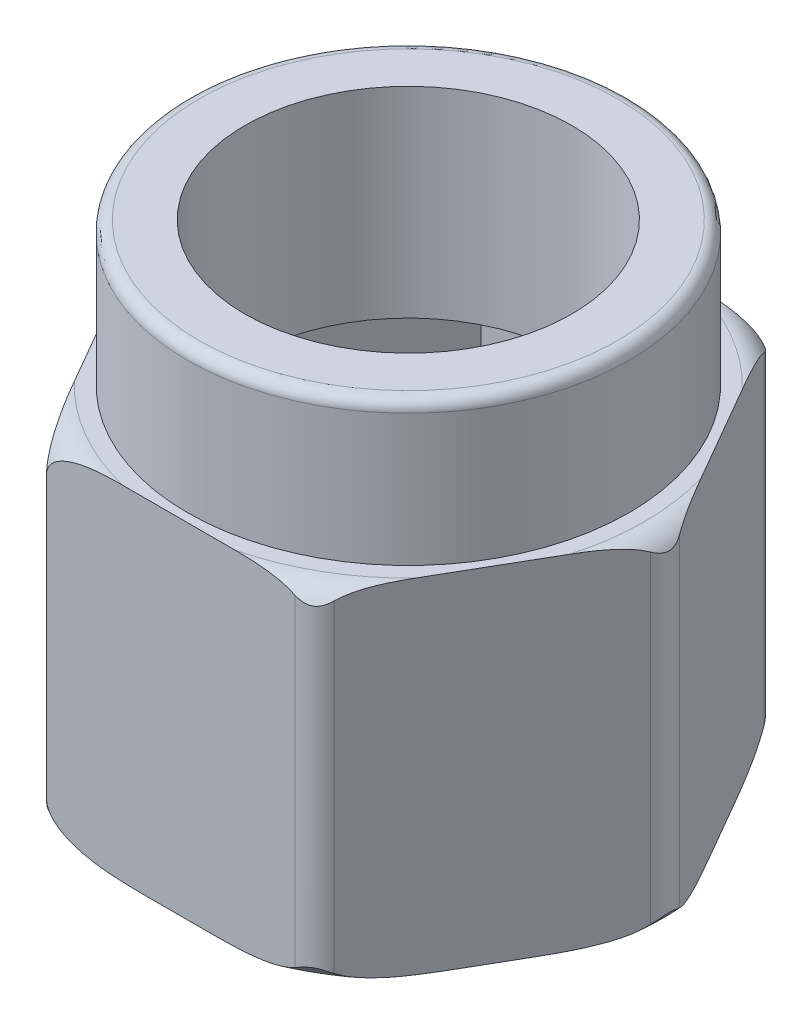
ISO-10303-21;
HEADER;
FILE_DESCRIPTION(('STEP AP214'),'2;1');
FILE_NAME('part.step','',(''),(''),'','','');
FILE_SCHEMA(('AUTOMOTIVE_DESIGN { 1 0 10303 214 1 1 1 1 }'));
ENDSEC;
DATA;
#1=APPLICATION_CONTEXT('core data for automotive mechanical design processes');
#2=APPLICATION_PROTOCOL_DEFINITION('international standard','automotive_design',2000,#1);
#3=PRODUCT_CONTEXT('',#1,'mechanical');
#4=PRODUCT('Part','Part','',(#3));
#5=PRODUCT_RELATED_PRODUCT_CATEGORY('part','',(#4));
#6=PRODUCT_DEFINITION_FORMATION('','',#4);
#7=PRODUCT_DEFINITION_CONTEXT('part definition',#1,'design');
#8=PRODUCT_DEFINITION('design','',#6,#7);
#9=PRODUCT_DEFINITION_SHAPE('','',#8);
#10=(LENGTH_UNIT() NAMED_UNIT(*) SI_UNIT(.MILLI.,.METRE.));
#11=(NAMED_UNIT(*) PLANE_ANGLE_UNIT() SI_UNIT($,.RADIAN.));
#12=(NAMED_UNIT(*) SI_UNIT($,.STERADIAN.) SOLID_ANGLE_UNIT());
#13=UNCERTAINTY_MEASURE_WITH_UNIT(LENGTH_MEASURE(1.E-05),#10,'distance_accuracy_value','');
#14=(GEOMETRIC_REPRESENTATION_CONTEXT(3) GLOBAL_UNCERTAINTY_ASSIGNED_CONTEXT((#13)) GLOBAL_UNIT_ASSIGNED_CONTEXT((#10,
#11,#12)) REPRESENTATION_CONTEXT('',''));
#15=CARTESIAN_POINT('',(0.,0.,0.));
#16=DIRECTION('',(0.,0.,1.));
#17=DIRECTION('',(1.,0.,0.));
#18=AXIS2_PLACEMENT_3D('',#15,#16,#17);
#19=CARTESIAN_POINT('',(0.,1.,0.));
#20=DIRECTION('',(0.,1.,0.));
#21=DIRECTION('',(0.,0.,1.));
#22=AXIS2_PLACEMENT_3D('',#19,#20,#21);
#23=PLANE('',#22);
#24=DIRECTION('',(0.5,0.,-0.866025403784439));
#25=VECTOR('',#24,1.);
#26=CARTESIAN_POINT('',(-1.44337567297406,1.,-3.5));
#27=LINE('',#26,#25);
#28=CARTESIAN_POINT('',(-3.46410161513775,1.,0.));
#29=VERTEX_POINT('',#28);
#30=CARTESIAN_POINT('',(-1.73205080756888,1.,-3.));
#31=VERTEX_POINT('',#30);
#32=EDGE_CURVE('E1213',#29,#31,#27,.T.);
#33=ORIENTED_EDGE('',*,*,#32,.F.);
#34=DIRECTION('',(-0.5,0.,-0.866025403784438));
#35=VECTOR('',#34,1.);
#36=CARTESIAN_POINT('',(-3.75277674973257,1.,-0.499999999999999));
#37=LINE('',#36,#35);
#38=CARTESIAN_POINT('',(-1.73205080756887,1.,3.));
#39=VERTEX_POINT('',#38);
#40=EDGE_CURVE('E1216',#39,#29,#37,.T.);
#41=ORIENTED_EDGE('',*,*,#40,.F.);
#42=DIRECTION('',(-1.,0.,0.));
#43=VECTOR('',#42,1.);
#44=CARTESIAN_POINT('',(-2.3094010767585,1.,3.));
#45=LINE('',#44,#43);
#46=CARTESIAN_POINT('',(1.73205080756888,1.,3.));
#47=VERTEX_POINT('',#46);
#48=EDGE_CURVE('E554',#47,#39,#45,.T.);
#49=ORIENTED_EDGE('',*,*,#48,.F.);
#50=DIRECTION('',(-0.5,0.,0.866025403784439));
#51=VECTOR('',#50,1.);
#52=CARTESIAN_POINT('',(1.44337567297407,1.,3.5));
#53=LINE('',#52,#51);
#54=CARTESIAN_POINT('',(3.46410161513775,1.,0.));
#55=VERTEX_POINT('',#54);
#56=EDGE_CURVE('E1248',#55,#47,#53,.T.);
#57=ORIENTED_EDGE('',*,*,#56,.F.);
#58=DIRECTION('',(0.5,0.,0.866025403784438));
#59=VECTOR('',#58,1.);
#60=CARTESIAN_POINT('',(3.75277674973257,1.,0.499999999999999));
#61=LINE('',#60,#59);
#62=CARTESIAN_POINT('',(1.73205080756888,1.,-3.));
#63=VERTEX_POINT('',#62);
#64=EDGE_CURVE('E1245',#63,#55,#61,.T.);
#65=ORIENTED_EDGE('',*,*,#64,.F.);
#66=DIRECTION('',(1.,0.,0.));
#67=VECTOR('',#66,1.);
#68=CARTESIAN_POINT('',(2.3094010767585,1.,-3.));
#69=LINE('',#68,#67);
#70=EDGE_CURVE('E1218',#31,#63,#69,.T.);
#71=ORIENTED_EDGE('',*,*,#70,.F.);
#72=EDGE_LOOP('',(#33,#41,#49,#57,#65,#71));
#73=FACE_BOUND('',#72,.T.);
#74=ADVANCED_FACE('F18',(#73),#23,.T.);
#75=CARTESIAN_POINT('',(-2.3094010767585,6.,3.));
#76=DIRECTION('',(0.,0.,-1.));
#77=DIRECTION('',(-1.,0.,0.));
#78=AXIS2_PLACEMENT_3D('',#75,#76,#77);
#79=PLANE('',#78);
#80=DIRECTION('',(1.,0.,0.));
#81=VECTOR('',#80,1.);
#82=CARTESIAN_POINT('',(0.,5.,3.));
#83=LINE('',#82,#81);
#84=CARTESIAN_POINT('',(-1.73205080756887,5.,3.));
#85=VERTEX_POINT('',#84);
#86=CARTESIAN_POINT('',(1.73205080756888,5.,3.));
#87=VERTEX_POINT('',#86);
#88=EDGE_CURVE('E1229',#85,#87,#83,.T.);
#89=ORIENTED_EDGE('',*,*,#88,.T.);
#90=DIRECTION('',(0.,1.,0.));
#91=VECTOR('',#90,1.);
#92=CARTESIAN_POINT('',(1.73205080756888,6.,3.));
#93=LINE('',#92,#91);
#94=EDGE_CURVE('E1247',#47,#87,#93,.T.);
#95=ORIENTED_EDGE('',*,*,#94,.F.);
#96=ORIENTED_EDGE('',*,*,#48,.T.);
#97=DIRECTION('',(0.,1.,0.));
#98=VECTOR('',#97,1.);
#99=CARTESIAN_POINT('',(-1.73205080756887,6.,3.));
#100=LINE('',#99,#98);
#101=EDGE_CURVE('E1234',#85,#39,#100,.F.);
#102=ORIENTED_EDGE('',*,*,#101,.F.);
#103=EDGE_LOOP('',(#89,#95,#96,#102));
#104=FACE_BOUND('',#103,.T.);
#105=ADVANCED_FACE('F1184',(#104),#79,.T.);
#106=CARTESIAN_POINT('',(1.44337567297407,6.,3.5));
#107=DIRECTION('',(-0.866025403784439,0.,-0.5));
#108=DIRECTION('',(-0.5,0.,0.866025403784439));
#109=AXIS2_PLACEMENT_3D('',#106,#107,#108);
#110=PLANE('',#109);
#111=ORIENTED_EDGE('',*,*,#56,.T.);
#112=ORIENTED_EDGE('',*,*,#94,.T.);
#113=DIRECTION('',(0.5,0.,-0.866025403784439));
#114=VECTOR('',#113,1.);
#115=CARTESIAN_POINT('',(1.73205080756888,5.,3.));
#116=LINE('',#115,#114);
#117=CARTESIAN_POINT('',(3.46410161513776,5.,0.));
#118=VERTEX_POINT('',#117);
#119=EDGE_CURVE('E1232',#87,#118,#116,.T.);
#120=ORIENTED_EDGE('',*,*,#119,.T.);
#121=DIRECTION('',(0.,1.,0.));
#122=VECTOR('',#121,1.);
#123=CARTESIAN_POINT('',(3.46410161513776,6.,0.));
#124=LINE('',#123,#122);
#125=EDGE_CURVE('E1243',#55,#118,#124,.T.);
#126=ORIENTED_EDGE('',*,*,#125,.F.);
#127=EDGE_LOOP('',(#111,#112,#120,#126));
#128=FACE_BOUND('',#127,.T.);
#129=ADVANCED_FACE('F1174',(#128),#110,.T.);
#130=CARTESIAN_POINT('',(3.75277674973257,6.,0.499999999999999));
#131=DIRECTION('',(-0.866025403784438,0.,0.5));
#132=DIRECTION('',(0.5,0.,0.866025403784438));
#133=AXIS2_PLACEMENT_3D('',#130,#131,#132);
#134=PLANE('',#133);
#135=ORIENTED_EDGE('',*,*,#64,.T.);
#136=ORIENTED_EDGE('',*,*,#125,.T.);
#137=DIRECTION('',(-0.5,0.,-0.866025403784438));
#138=VECTOR('',#137,1.);
#139=CARTESIAN_POINT('',(3.46410161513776,5.,0.));
#140=LINE('',#139,#138);
#141=CARTESIAN_POINT('',(1.73205080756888,5.,-3.));
#142=VERTEX_POINT('',#141);
#143=EDGE_CURVE('E1266',#118,#142,#140,.T.);
#144=ORIENTED_EDGE('',*,*,#143,.T.);
#145=DIRECTION('',(0.,1.,0.));
#146=VECTOR('',#145,1.);
#147=CARTESIAN_POINT('',(1.73205080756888,6.,-3.));
#148=LINE('',#147,#146);
#149=EDGE_CURVE('E1221',#63,#142,#148,.T.);
#150=ORIENTED_EDGE('',*,*,#149,.F.);
#151=EDGE_LOOP('',(#135,#136,#144,#150));
#152=FACE_BOUND('',#151,.T.);
#153=ADVANCED_FACE('F1164',(#152),#134,.T.);
#154=CARTESIAN_POINT('',(2.3094010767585,6.,-3.));
#155=DIRECTION('',(0.,0.,1.));
#156=DIRECTION('',(1.,0.,0.));
#157=AXIS2_PLACEMENT_3D('',#154,#155,#156);
#158=PLANE('',#157);
#159=ORIENTED_EDGE('',*,*,#70,.T.);
#160=ORIENTED_EDGE('',*,*,#149,.T.);
#161=DIRECTION('',(1.,0.,0.));
#162=VECTOR('',#161,1.);
#163=CARTESIAN_POINT('',(0.,5.,-3.));
#164=LINE('',#163,#162);
#165=CARTESIAN_POINT('',(-1.73205080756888,5.,-3.));
#166=VERTEX_POINT('',#165);
#167=EDGE_CURVE('E1257',#142,#166,#164,.F.);
#168=ORIENTED_EDGE('',*,*,#167,.T.);
#169=DIRECTION('',(0.,1.,0.));
#170=VECTOR('',#169,1.);
#171=CARTESIAN_POINT('',(-1.73205080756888,6.,-3.));
#172=LINE('',#171,#170);
#173=EDGE_CURVE('E1220',#31,#166,#172,.T.);
#174=ORIENTED_EDGE('',*,*,#173,.F.);
#175=EDGE_LOOP('',(#159,#160,#168,#174));
#176=FACE_BOUND('',#175,.T.);
#177=ADVANCED_FACE('F1154',(#176),#158,.T.);
#178=CARTESIAN_POINT('',(-1.44337567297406,6.,-3.5));
#179=DIRECTION('',(0.866025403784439,0.,0.5));
#180=DIRECTION('',(0.5,0.,-0.866025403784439));
#181=AXIS2_PLACEMENT_3D('',#178,#179,#180);
#182=PLANE('',#181);
#183=ORIENTED_EDGE('',*,*,#32,.T.);
#184=ORIENTED_EDGE('',*,*,#173,.T.);
#185=DIRECTION('',(-0.5,0.,0.866025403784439));
#186=VECTOR('',#185,1.);
#187=CARTESIAN_POINT('',(-1.73205080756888,5.,-3.));
#188=LINE('',#187,#186);
#189=CARTESIAN_POINT('',(-3.46410161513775,5.,0.));
#190=VERTEX_POINT('',#189);
#191=EDGE_CURVE('E1226',#166,#190,#188,.T.);
#192=ORIENTED_EDGE('',*,*,#191,.T.);
#193=DIRECTION('',(0.,1.,0.));
#194=VECTOR('',#193,1.);
#195=CARTESIAN_POINT('',(-3.46410161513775,6.,0.));
#196=LINE('',#195,#194);
#197=EDGE_CURVE('E1224',#29,#190,#196,.T.);
#198=ORIENTED_EDGE('',*,*,#197,.F.);
#199=EDGE_LOOP('',(#183,#184,#192,#198));
#200=FACE_BOUND('',#199,.T.);
#201=ADVANCED_FACE('F1144',(#200),#182,.T.);
#202=CARTESIAN_POINT('',(-3.75277674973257,6.,-0.499999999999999));
#203=DIRECTION('',(0.866025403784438,0.,-0.5));
#204=DIRECTION('',(-0.5,0.,-0.866025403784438));
#205=AXIS2_PLACEMENT_3D('',#202,#203,#204);
#206=PLANE('',#205);
#207=ORIENTED_EDGE('',*,*,#40,.T.);
#208=ORIENTED_EDGE('',*,*,#197,.T.);
#209=DIRECTION('',(0.5,0.,0.866025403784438));
#210=VECTOR('',#209,1.);
#211=CARTESIAN_POINT('',(-3.46410161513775,5.,0.));
#212=LINE('',#211,#210);
#213=EDGE_CURVE('E1253',#190,#85,#212,.T.);
#214=ORIENTED_EDGE('',*,*,#213,.T.);
#215=ORIENTED_EDGE('',*,*,#101,.T.);
#216=EDGE_LOOP('',(#207,#208,#214,#215));
#217=FACE_BOUND('',#216,.T.);
#218=ADVANCED_FACE('F1134',(#217),#206,.T.);
#219=CARTESIAN_POINT('',(0.,5.,0.));
#220=DIRECTION('',(0.,1.,0.));
#221=DIRECTION('',(0.,0.,1.));
#222=AXIS2_PLACEMENT_3D('',#219,#220,#221);
#223=PLANE('',#222);
#224=ORIENTED_EDGE('',*,*,#191,.F.);
#225=ORIENTED_EDGE('',*,*,#167,.F.);
#226=ORIENTED_EDGE('',*,*,#143,.F.);
#227=ORIENTED_EDGE('',*,*,#119,.F.);
#228=ORIENTED_EDGE('',*,*,#88,.F.);
#229=ORIENTED_EDGE('',*,*,#213,.F.);
#230=EDGE_LOOP('',(#224,#225,#226,#227,#228,#229));
#231=FACE_BOUND('',#230,.T.);
#232=CARTESIAN_POINT('',(0.,5.,0.));
#233=DIRECTION('',(0.,-1.,0.));
#234=DIRECTION('',(0.,0.,-1.));
#235=AXIS2_PLACEMENT_3D('',#232,#233,#234);
#236=CIRCLE('',#235,2.85);
#237=CARTESIAN_POINT('',(0.,5.,-2.85));
#238=VERTEX_POINT('',#237);
#239=EDGE_CURVE('E1254',#238,#238,#236,.F.);
#240=ORIENTED_EDGE('',*,*,#239,.T.);
#241=EDGE_LOOP('',(#240));
#242=FACE_BOUND('',#241,.T.);
#243=ADVANCED_FACE('F1124',(#231,#242),#223,.F.);
#244=CARTESIAN_POINT('',(0.,8.5,0.));
#245=DIRECTION('',(0.,-1.,0.));
#246=DIRECTION('',(0.,0.,-1.));
#247=AXIS2_PLACEMENT_3D('',#244,#245,#246);
#248=CYLINDRICAL_SURFACE('',#247,2.85);
#249=CARTESIAN_POINT('',(0.,8.5,0.));
#250=DIRECTION('',(0.,-1.,0.));
#251=DIRECTION('',(0.,0.,-1.));
#252=AXIS2_PLACEMENT_3D('',#249,#250,#251);
#253=CIRCLE('',#252,2.85);
#254=CARTESIAN_POINT('',(0.,8.5,-2.85));
#255=VERTEX_POINT('',#254);
#256=EDGE_CURVE('E436',#255,#255,#253,.T.);
#257=ORIENTED_EDGE('',*,*,#256,.F.);
#258=EDGE_LOOP('',(#257));
#259=FACE_BOUND('',#258,.T.);
#260=ORIENTED_EDGE('',*,*,#239,.F.);
#261=EDGE_LOOP('',(#260));
#262=FACE_BOUND('',#261,.T.);
#263=ADVANCED_FACE('F1114',(#259,#262),#248,.F.);
#264=CARTESIAN_POINT('',(0.,8.5,0.));
#265=DIRECTION('',(0.,1.,0.));
#266=DIRECTION('',(0.,0.,1.));
#267=AXIS2_PLACEMENT_3D('',#264,#265,#266);
#268=PLANE('',#267);
#269=ORIENTED_EDGE('',*,*,#256,.T.);
#270=EDGE_LOOP('',(#269));
#271=FACE_BOUND('',#270,.T.);
#272=CARTESIAN_POINT('',(0.,8.5,0.));
#273=DIRECTION('',(0.,-1.,0.));
#274=DIRECTION('',(0.,0.,-1.));
#275=AXIS2_PLACEMENT_3D('',#272,#273,#274);
#276=CIRCLE('',#275,3.65);
#277=CARTESIAN_POINT('',(0.,8.5,-3.65));
#278=VERTEX_POINT('',#277);
#279=CARTESIAN_POINT('',(0.,8.5,3.65));
#280=VERTEX_POINT('',#279);
#281=EDGE_CURVE('E1291',#278,#280,#276,.T.);
#282=ORIENTED_EDGE('',*,*,#281,.F.);
#283=CARTESIAN_POINT('',(0.,8.5,0.));
#284=DIRECTION('',(0.,-1.,0.));
#285=DIRECTION('',(0.,0.,1.));
#286=AXIS2_PLACEMENT_3D('',#283,#284,#285);
#287=CIRCLE('',#286,3.65);
#288=EDGE_CURVE('E1300',#280,#278,#287,.T.);
#289=ORIENTED_EDGE('',*,*,#288,.F.);
#290=EDGE_LOOP('',(#282,#289));
#291=FACE_BOUND('',#290,.T.);
#292=ADVANCED_FACE('F1105',(#271,#291),#268,.T.);
#293=CARTESIAN_POINT('',(0.,8.3,0.));
#294=DIRECTION('',(0.,1.,0.));
#295=DIRECTION('',(0.,0.,1.));
#296=AXIS2_PLACEMENT_3D('',#293,#294,#295);
#297=TOROIDAL_SURFACE('',#296,3.65,0.2);
#298=ORIENTED_EDGE('',*,*,#288,.T.);
#299=ORIENTED_EDGE('',*,*,#281,.T.);
#300=EDGE_LOOP('',(#298,#299));
#301=FACE_BOUND('',#300,.T.);
#302=CARTESIAN_POINT('',(0.,8.3,0.));
#303=DIRECTION('',(0.,-1.,0.));
#304=DIRECTION('',(0.,0.,-1.));
#305=AXIS2_PLACEMENT_3D('',#302,#303,#304);
#306=CIRCLE('',#305,3.85);
#307=CARTESIAN_POINT('',(0.,8.3,-3.85));
#308=VERTEX_POINT('',#307);
#309=EDGE_CURVE('E405',#308,#308,#306,.T.);
#310=ORIENTED_EDGE('',*,*,#309,.F.);
#311=EDGE_LOOP('',(#310));
#312=FACE_BOUND('',#311,.T.);
#313=ADVANCED_FACE('F1096',(#301,#312),#297,.T.);
#314=CARTESIAN_POINT('',(0.,8.5,0.));
#315=DIRECTION('',(0.,-1.,0.));
#316=DIRECTION('',(0.,0.,-1.));
#317=AXIS2_PLACEMENT_3D('',#314,#315,#316);
#318=CYLINDRICAL_SURFACE('',#317,3.85);
#319=CARTESIAN_POINT('',(0.,6.,0.));
#320=DIRECTION('',(0.,-1.,0.));
#321=DIRECTION('',(0.,0.,-1.));
#322=AXIS2_PLACEMENT_3D('',#319,#320,#321);
#323=CIRCLE('',#322,3.85);
#324=CARTESIAN_POINT('',(0.,6.,-3.85));
#325=VERTEX_POINT('',#324);
#326=EDGE_CURVE('E396',#325,#325,#323,.T.);
#327=ORIENTED_EDGE('',*,*,#326,.F.);
#328=EDGE_LOOP('',(#327));
#329=FACE_BOUND('',#328,.T.);
#330=ORIENTED_EDGE('',*,*,#309,.T.);
#331=EDGE_LOOP('',(#330));
#332=FACE_BOUND('',#331,.T.);
#333=ADVANCED_FACE('F416',(#329,#332),#318,.T.);
#334=CARTESIAN_POINT('',(0.,5.5,0.));
#335=DIRECTION('',(0.,1.,0.));
#336=DIRECTION('',(0.,0.,1.));
#337=AXIS2_PLACEMENT_3D('',#334,#335,#336);
#338=TOROIDAL_SURFACE('',#337,4.118802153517,0.5);
#339=CARTESIAN_POINT('',(0.,6.,0.));
#340=DIRECTION('',(0.,-1.,0.));
#341=DIRECTION('',(-0.238444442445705,0.,0.971156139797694));
#342=AXIS2_PLACEMENT_3D('',#339,#340,#341);
#343=CIRCLE('',#342,4.118802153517);
#344=CARTESIAN_POINT('',(-2.97304887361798,6.,2.85052829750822));
#345=VERTEX_POINT('',#344);
#346=CARTESIAN_POINT('',(-0.982105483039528,6.,4.));
#347=VERTEX_POINT('',#346);
#348=EDGE_CURVE('E314',#345,#347,#343,.F.);
#349=ORIENTED_EDGE('',*,*,#348,.F.);
#350=CARTESIAN_POINT('',(-2.97304887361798,6.,2.85052829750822));
#351=CARTESIAN_POINT('',(-2.94968079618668,5.99999094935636,2.89100299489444));
#352=CARTESIAN_POINT('',(-2.92630841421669,5.99962664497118,2.93148514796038));
#353=CARTESIAN_POINT('',(-2.87940559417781,5.99781952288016,3.01272321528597));
#354=CARTESIAN_POINT('',(-2.85587523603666,5.99636892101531,3.05347899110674));
#355=CARTESIAN_POINT('',(-2.8087796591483,5.99200463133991,3.13505092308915));
#356=CARTESIAN_POINT('',(-2.78521452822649,5.98908684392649,3.17586692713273));
#357=CARTESIAN_POINT('',(-2.73774433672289,5.98126063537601,3.25808771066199));
#358=CARTESIAN_POINT('',(-2.713840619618,5.97631798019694,3.29949016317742));
#359=CARTESIAN_POINT('',(-2.66625129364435,5.96386908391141,3.38191729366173));
#360=CARTESIAN_POINT('',(-2.64256531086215,5.95636873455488,3.42294261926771));
#361=CARTESIAN_POINT('',(-2.59554200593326,5.93806896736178,3.50438937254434));
#362=CARTESIAN_POINT('',(-2.57220414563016,5.92727535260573,3.54481173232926));
#363=CARTESIAN_POINT('',(-2.53327754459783,5.90539459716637,3.61223458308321));
#364=CARTESIAN_POINT('',(-2.5175313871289,5.8954378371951,3.63950772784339));
#365=CARTESIAN_POINT('',(-2.48648316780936,5.87302384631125,3.69328482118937));
#366=CARTESIAN_POINT('',(-2.4711810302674,5.86056704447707,3.71978890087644));
#367=CARTESIAN_POINT('',(-2.44115688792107,5.83246904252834,3.77179224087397));
#368=CARTESIAN_POINT('',(-2.42644083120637,5.81680198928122,3.79728119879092));
#369=CARTESIAN_POINT('',(-2.39821417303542,5.78161857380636,3.84617120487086));
#370=CARTESIAN_POINT('',(-2.38470001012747,5.7621141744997,3.86957842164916));
#371=CARTESIAN_POINT('',(-2.36516865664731,5.72794571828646,3.90340771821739));
#372=CARTESIAN_POINT('',(-2.35845366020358,5.71488432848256,3.91503843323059));
#373=CARTESIAN_POINT('',(-2.34590883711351,5.68711627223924,3.93676670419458));
#374=CARTESIAN_POINT('',(-2.34007949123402,5.67240871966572,3.94686342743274));
#375=CARTESIAN_POINT('',(-2.32956748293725,5.64112443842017,3.96507075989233));
#376=CARTESIAN_POINT('',(-2.32490085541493,5.62452573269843,3.97315359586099));
#377=CARTESIAN_POINT('',(-2.31724290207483,5.58986910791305,3.98641756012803));
#378=CARTESIAN_POINT('',(-2.31424495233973,5.57181728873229,3.99161016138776));
#379=CARTESIAN_POINT('',(-2.31131658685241,5.54459888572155,3.99668223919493));
#380=CARTESIAN_POINT('',(-2.31060211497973,5.53575387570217,3.99791974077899));
#381=CARTESIAN_POINT('',(-2.30964304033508,5.51794200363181,3.99958090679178));
#382=CARTESIAN_POINT('',(-2.30939954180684,5.50897490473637,4.00000265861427));
#383=CARTESIAN_POINT('',(-2.3094010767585,5.5,4.));
#384=B_SPLINE_CURVE_WITH_KNOTS('',3,(#350,#351,#352,#353,#354,#355,#356,#357,#358,#359,#360,
#361,#362,#363,#364,#365,#366,#367,#368,#369,#370,#371,#372,#373,#374,#375,#376,#377,#378,#379,
#380,#381,#382,#383),.UNSPECIFIED.,.F.,.F.,(4,2,2,2,2,2,2,2,2,2,2,2,2,2,2,2,4),(0.,
0.140220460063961,0.281455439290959,0.423087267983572,0.567219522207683,0.711021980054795,
0.854572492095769,0.953578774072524,1.05256807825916,1.15238833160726,1.25190219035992,
1.30798429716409,1.36409673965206,1.42094481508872,1.47756558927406,1.50439990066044,
1.53129705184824),.UNSPECIFIED.);
#385=CARTESIAN_POINT('',(-2.3094010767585,5.5,4.));
#386=VERTEX_POINT('',#385);
#387=EDGE_CURVE('E225',#345,#386,#384,.T.);
#388=ORIENTED_EDGE('',*,*,#387,.T.);
#389=CARTESIAN_POINT('',(-2.3094010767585,5.5,4.));
#390=CARTESIAN_POINT('',(-2.30943681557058,5.51501174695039,4.));
#391=CARTESIAN_POINT('',(-2.30805113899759,5.5299845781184,4.));
#392=CARTESIAN_POINT('',(-2.30274993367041,5.55934627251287,4.));
#393=CARTESIAN_POINT('',(-2.29885666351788,5.57373910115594,4.));
#394=CARTESIAN_POINT('',(-2.28885820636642,5.60166983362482,4.));
#395=CARTESIAN_POINT('',(-2.28275950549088,5.61521010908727,4.));
#396=CARTESIAN_POINT('',(-2.26873893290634,5.64133333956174,4.));
#397=CARTESIAN_POINT('',(-2.2608128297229,5.65391398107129,4.));
#398=CARTESIAN_POINT('',(-2.23765313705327,5.68620616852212,4.));
#399=CARTESIAN_POINT('',(-2.22110658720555,5.70497508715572,4.));
#400=CARTESIAN_POINT('',(-2.18533322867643,5.73974285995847,4.));
#401=CARTESIAN_POINT('',(-2.1660991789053,5.75573395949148,4.));
#402=CARTESIAN_POINT('',(-2.11088831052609,5.79631890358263,4.));
#403=CARTESIAN_POINT('',(-2.07311429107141,5.81844533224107,4.));
#404=CARTESIAN_POINT('',(-1.99487804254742,5.85714115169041,4.));
#405=CARTESIAN_POINT('',(-1.95440947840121,5.8736968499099,4.));
#406=CARTESIAN_POINT('',(-1.85740068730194,5.90769420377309,4.));
#407=CARTESIAN_POINT('',(-1.80025109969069,5.92336735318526,4.));
#408=CARTESIAN_POINT('',(-1.68468563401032,5.94920013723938,4.));
#409=CARTESIAN_POINT('',(-1.62626737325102,5.95934825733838,4.));
#410=CARTESIAN_POINT('',(-1.50867645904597,5.97562794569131,4.));
#411=CARTESIAN_POINT('',(-1.44950181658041,5.98174454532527,4.));
#412=CARTESIAN_POINT('',(-1.33091897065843,5.99101989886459,4.));
#413=CARTESIAN_POINT('',(-1.27151069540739,5.99417765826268,4.));
#414=CARTESIAN_POINT('',(-1.17362955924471,5.9976544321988,4.));
#415=CARTESIAN_POINT('',(-1.13517512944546,5.99858220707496,4.));
#416=CARTESIAN_POINT('',(-1.05851484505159,5.99975106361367,4.));
#417=CARTESIAN_POINT('',(-1.02030906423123,5.99999673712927,4.));
#418=CARTESIAN_POINT('',(-0.982105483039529,6.,4.));
#419=B_SPLINE_CURVE_WITH_KNOTS('',3,(#389,#390,#391,#392,#393,#394,#395,#396,#397,#398,#399,
#400,#401,#402,#403,#404,#405,#406,#407,#408,#409,#410,#411,#412,#413,#414,#415,#416,#417,#418),
.UNSPECIFIED.,.F.,.F.,(4,2,2,2,2,2,2,2,2,2,2,2,2,2,4),(0.,0.044909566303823,0.0894258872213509,
0.133812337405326,0.178302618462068,0.252931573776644,0.327765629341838,0.458355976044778,
0.589265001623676,0.766605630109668,0.944314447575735,1.12267941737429,1.30110431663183,
1.41649577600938,1.53110852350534),.UNSPECIFIED.);
#420=EDGE_CURVE('E392',#386,#347,#419,.T.);
#421=ORIENTED_EDGE('',*,*,#420,.T.);
#422=EDGE_LOOP('',(#349,#388,#421));
#423=FACE_BOUND('',#422,.T.);
#424=ADVANCED_FACE('F395',(#423),#338,.T.);
#425=CARTESIAN_POINT('',(0.,5.5,0.));
#426=DIRECTION('',(0.,1.,0.));
#427=DIRECTION('',(0.,0.,1.));
#428=AXIS2_PLACEMENT_3D('',#425,#426,#427);
#429=TOROIDAL_SURFACE('',#428,4.118802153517,0.5);
#430=CARTESIAN_POINT('',(2.45373864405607,5.84422588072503,3.74999999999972));
#431=CARTESIAN_POINT('',(2.46446861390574,5.85440731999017,3.73141514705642));
#432=CARTESIAN_POINT('',(2.47537724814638,5.86379510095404,3.71252083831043));
#433=CARTESIAN_POINT('',(2.49743628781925,5.88115111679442,3.67431346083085));
#434=CARTESIAN_POINT('',(2.50858585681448,5.88912358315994,3.65500184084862));
#435=CARTESIAN_POINT('',(2.53106988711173,5.90387132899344,3.61605835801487));
#436=CARTESIAN_POINT('',(2.54240421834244,5.91064741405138,3.59642672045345));
#437=CARTESIAN_POINT('',(2.56511169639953,5.9231038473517,3.55709621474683));
#438=CARTESIAN_POINT('',(2.57648357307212,5.92879351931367,3.5373995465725));
#439=CARTESIAN_POINT('',(2.59933701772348,5.9392824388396,3.49781621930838));
#440=CARTESIAN_POINT('',(2.61081865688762,5.94408106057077,3.47792943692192));
#441=CARTESIAN_POINT('',(2.63385926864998,5.95289143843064,3.43802192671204));
#442=CARTESIAN_POINT('',(2.64541825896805,5.95690300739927,3.41800116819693));
#443=CARTESIAN_POINT('',(2.67427850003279,5.96603112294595,3.36801376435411));
#444=CARTESIAN_POINT('',(2.6916132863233,5.9707234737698,3.33798903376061));
#445=CARTESIAN_POINT('',(2.7263543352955,5.97882878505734,3.27781577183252));
#446=CARTESIAN_POINT('',(2.74376059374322,5.98224182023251,3.24766724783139));
#447=CARTESIAN_POINT('',(2.77862163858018,5.98801028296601,3.18728614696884));
#448=CARTESIAN_POINT('',(2.79607643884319,5.9903653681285,3.15705354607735));
#449=CARTESIAN_POINT('',(2.83125919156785,5.99423354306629,3.09611523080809));
#450=CARTESIAN_POINT('',(2.8489874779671,5.99573409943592,3.06540893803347));
#451=CARTESIAN_POINT('',(2.8844477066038,5.99801460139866,3.0039900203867));
#452=CARTESIAN_POINT('',(2.90217964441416,5.99879484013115,2.9732774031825));
#453=CARTESIAN_POINT('',(2.93762443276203,5.99978577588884,2.91188522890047));
#454=CARTESIAN_POINT('',(2.95533727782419,5.99999721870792,2.8812056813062));
#455=CARTESIAN_POINT('',(2.97304887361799,6.,2.85052829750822));
#456=B_SPLINE_CURVE_WITH_KNOTS('',3,(#430,#431,#432,#433,#434,#435,#436,#437,#438,#439,#440,
#441,#442,#443,#444,#445,#446,#447,#448,#449,#450,#451,#452,#453,#454,#455),.UNSPECIFIED.,.F.,
.F.,(4,2,2,2,2,2,2,2,2,2,2,2,4),(0.,0.0712170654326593,0.142217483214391,0.21316990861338,
0.283482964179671,0.353845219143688,0.424224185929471,0.529149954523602,0.634069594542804,
0.739023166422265,0.84547887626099,0.951891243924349,1.05816401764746),.UNSPECIFIED.);
#457=CARTESIAN_POINT('',(2.45373864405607,5.84422588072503,3.74999999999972));
#458=VERTEX_POINT('',#457);
#459=CARTESIAN_POINT('',(2.97304887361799,6.,2.85052829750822));
#460=VERTEX_POINT('',#459);
#461=EDGE_CURVE('E224',#458,#460,#456,.T.);
#462=ORIENTED_EDGE('',*,*,#461,.T.);
#463=CARTESIAN_POINT('',(0.,6.,0.));
#464=DIRECTION('',(0.,-1.,0.));
#465=DIRECTION('',(0.721823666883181,0.,0.692077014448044));
#466=AXIS2_PLACEMENT_3D('',#463,#464,#465);
#467=CIRCLE('',#466,4.118802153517);
#468=CARTESIAN_POINT('',(0.982105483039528,6.,4.));
#469=VERTEX_POINT('',#468);
#470=EDGE_CURVE('E218',#469,#460,#467,.F.);
#471=ORIENTED_EDGE('',*,*,#470,.F.);
#472=CARTESIAN_POINT('',(0.982105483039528,6.,4.));
#473=CARTESIAN_POINT('',(1.02719114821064,5.99999227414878,4.));
#474=CARTESIAN_POINT('',(1.07228397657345,5.99965264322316,4.));
#475=CARTESIAN_POINT('',(1.16269759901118,5.99798286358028,4.));
#476=CARTESIAN_POINT('',(1.20801828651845,5.99664729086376,4.));
#477=CARTESIAN_POINT('',(1.29869791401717,5.99264781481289,4.));
#478=CARTESIAN_POINT('',(1.34405674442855,5.98998121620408,4.));
#479=CARTESIAN_POINT('',(1.4336084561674,5.98299831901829,4.));
#480=CARTESIAN_POINT('',(1.47780427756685,5.97872114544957,4.));
#481=CARTESIAN_POINT('',(1.56587635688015,5.96807481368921,4.));
#482=CARTESIAN_POINT('',(1.60975302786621,5.96170919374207,4.));
#483=CARTESIAN_POINT('',(1.69699684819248,5.94633575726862,4.));
#484=CARTESIAN_POINT('',(1.74036456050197,5.93733121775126,4.));
#485=CARTESIAN_POINT('',(1.8238927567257,5.91654737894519,4.));
#486=CARTESIAN_POINT('',(1.86409708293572,5.9049511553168,4.));
#487=CARTESIAN_POINT('',(1.92356265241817,5.8846418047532,4.));
#488=CARTESIAN_POINT('',(1.94331082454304,5.8773560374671,4.));
#489=CARTESIAN_POINT('',(1.982376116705,5.8616656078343,4.));
#490=CARTESIAN_POINT('',(2.00169283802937,5.85325995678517,4.));
#491=CARTESIAN_POINT('',(2.02072594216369,5.84422588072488,4.));
#492=B_SPLINE_CURVE_WITH_KNOTS('',3,(#472,#473,#474,#475,#476,#477,#478,#479,#480,#481,#482,
#483,#484,#485,#486,#487,#488,#489,#490,#491),.UNSPECIFIED.,.F.,.F.,(4,2,2,2,2,2,2,2,2,4),(0.,
0.135266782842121,0.271275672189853,0.407561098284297,0.54072955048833,0.673673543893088,
0.80645314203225,0.931816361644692,0.994933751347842,1.05810723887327),.UNSPECIFIED.);
#493=CARTESIAN_POINT('',(2.02072594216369,5.84422588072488,4.));
#494=VERTEX_POINT('',#493);
#495=EDGE_CURVE('E212',#469,#494,#492,.T.);
#496=ORIENTED_EDGE('',*,*,#495,.T.);
#497=CARTESIAN_POINT('',(2.45373864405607,5.84422588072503,3.74999999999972));
#498=CARTESIAN_POINT('',(2.44849524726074,5.83924876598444,3.75907894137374));
#499=CARTESIAN_POINT('',(2.44295439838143,5.83432551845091,3.76801914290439));
#500=CARTESIAN_POINT('',(2.43126292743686,5.82469324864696,3.78560683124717));
#501=CARTESIAN_POINT('',(2.42511246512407,5.81998417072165,3.79425439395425));
#502=CARTESIAN_POINT('',(2.41207795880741,5.81080925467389,3.81138593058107));
#503=CARTESIAN_POINT('',(2.4051835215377,5.80634868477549,3.81986488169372));
#504=CARTESIAN_POINT('',(2.39071735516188,5.79789208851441,3.83649379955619));
#505=CARTESIAN_POINT('',(2.38314465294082,5.79389674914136,3.84464326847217));
#506=CARTESIAN_POINT('',(2.36291267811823,5.78450235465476,3.8649832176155));
#507=CARTESIAN_POINT('',(2.34976153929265,5.77955362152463,3.87690833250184));
#508=CARTESIAN_POINT('',(2.32187092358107,5.77193595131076,3.89954027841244));
#509=CARTESIAN_POINT('',(2.30713551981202,5.7692613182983,3.91025009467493));
#510=CARTESIAN_POINT('',(2.27628559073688,5.76673010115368,3.93014823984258));
#511=CARTESIAN_POINT('',(2.26016256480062,5.76689232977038,3.93932600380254));
#512=CARTESIAN_POINT('',(2.22718844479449,5.77004633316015,3.95575722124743));
#513=CARTESIAN_POINT('',(2.21033524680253,5.77304688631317,3.96300461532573));
#514=CARTESIAN_POINT('',(2.17213237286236,5.78231001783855,3.97706449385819));
#515=CARTESIAN_POINT('',(2.15073149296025,5.78920909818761,3.98329529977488));
#516=CARTESIAN_POINT('',(2.10804825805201,5.80506514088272,3.99280336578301));
#517=CARTESIAN_POINT('',(2.08676617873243,5.81402571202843,3.99607539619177));
#518=CARTESIAN_POINT('',(2.05808036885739,5.82684086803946,3.99865968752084));
#519=CARTESIAN_POINT('',(2.05057001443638,5.83026525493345,3.99916492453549));
#520=CARTESIAN_POINT('',(2.0356110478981,5.83719171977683,3.99983422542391));
#521=CARTESIAN_POINT('',(2.02816231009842,5.84069337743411,3.9999998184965));
#522=CARTESIAN_POINT('',(2.02072594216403,5.8442258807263,3.99999999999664));
#523=B_SPLINE_CURVE_WITH_KNOTS('',3,(#497,#498,#499,#500,#501,#502,#503,#504,#505,#506,#507,
#508,#509,#510,#511,#512,#513,#514,#515,#516,#517,#518,#519,#520,#521,#522),.UNSPECIFIED.,.F.,
.F.,(4,2,2,2,2,2,2,2,2,2,2,2,4),(0.,0.0348162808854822,0.069623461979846,0.105002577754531,
0.140433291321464,0.195513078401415,0.250454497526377,0.30576039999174,0.361237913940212,
0.430855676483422,0.50059625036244,0.525400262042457,0.550092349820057),.UNSPECIFIED.);
#524=EDGE_CURVE('E215',#458,#494,#523,.T.);
#525=ORIENTED_EDGE('',*,*,#524,.F.);
#526=EDGE_LOOP('',(#462,#471,#496,#525));
#527=FACE_BOUND('',#526,.T.);
#528=ADVANCED_FACE('F214',(#527),#429,.T.);
#529=CARTESIAN_POINT('',(0.,5.5,0.));
#530=DIRECTION('',(0.,1.,0.));
#531=DIRECTION('',(0.,0.,1.));
#532=AXIS2_PLACEMENT_3D('',#529,#530,#531);
#533=TOROIDAL_SURFACE('',#532,4.118802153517,0.5);
#534=CARTESIAN_POINT('',(4.47446458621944,5.84422588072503,-0.250000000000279));
#535=CARTESIAN_POINT('',(4.46373461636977,5.85440731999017,-0.268584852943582));
#536=CARTESIAN_POINT('',(4.45282598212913,5.86379510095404,-0.287479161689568));
#537=CARTESIAN_POINT('',(4.43076694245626,5.88115111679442,-0.325686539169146));
#538=CARTESIAN_POINT('',(4.41961737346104,5.88912358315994,-0.344998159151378));
#539=CARTESIAN_POINT('',(4.39713334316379,5.90387132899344,-0.383941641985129));
#540=CARTESIAN_POINT('',(4.38579901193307,5.91064741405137,-0.403573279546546));
#541=CARTESIAN_POINT('',(4.36309153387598,5.9231038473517,-0.442903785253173));
#542=CARTESIAN_POINT('',(4.3517196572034,5.92879351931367,-0.462600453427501));
#543=CARTESIAN_POINT('',(4.32886621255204,5.9392824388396,-0.502183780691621));
#544=CARTESIAN_POINT('',(4.3173845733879,5.94408106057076,-0.522070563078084));
#545=CARTESIAN_POINT('',(4.29434396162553,5.95289143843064,-0.561978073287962));
#546=CARTESIAN_POINT('',(4.28278497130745,5.95690300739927,-0.58199883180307));
#547=CARTESIAN_POINT('',(4.25392473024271,5.96603112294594,-0.631986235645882));
#548=CARTESIAN_POINT('',(4.23658994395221,5.9707234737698,-0.662010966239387));
#549=CARTESIAN_POINT('',(4.20184889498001,5.97882878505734,-0.722184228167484));
#550=CARTESIAN_POINT('',(4.18444263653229,5.98224182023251,-0.752332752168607));
#551=CARTESIAN_POINT('',(4.14958159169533,5.98801028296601,-0.812713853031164));
#552=CARTESIAN_POINT('',(4.13212679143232,5.9903653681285,-0.842946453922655));
#553=CARTESIAN_POINT('',(4.09694403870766,5.99423354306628,-0.903884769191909));
#554=CARTESIAN_POINT('',(4.07921575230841,5.99573409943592,-0.934591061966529));
#555=CARTESIAN_POINT('',(4.04375552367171,5.99801460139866,-0.996009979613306));
#556=CARTESIAN_POINT('',(4.02602358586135,5.99879484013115,-1.0267225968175));
#557=CARTESIAN_POINT('',(3.99057879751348,5.99978577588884,-1.08811477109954));
#558=CARTESIAN_POINT('',(3.97286595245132,5.99999721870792,-1.1187943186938));
#559=CARTESIAN_POINT('',(3.95515435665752,6.,-1.14947170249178));
#560=B_SPLINE_CURVE_WITH_KNOTS('',3,(#534,#535,#536,#537,#538,#539,#540,#541,#542,#543,#544,
#545,#546,#547,#548,#549,#550,#551,#552,#553,#554,#555,#556,#557,#558,#559),.UNSPECIFIED.,.F.,
.F.,(4,2,2,2,2,2,2,2,2,2,2,2,4),(0.,0.0712170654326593,0.14221748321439,0.213169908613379,
0.283482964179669,0.353845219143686,0.424224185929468,0.529149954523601,0.634069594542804,
0.739023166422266,0.845478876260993,0.951891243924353,1.05816401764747),.UNSPECIFIED.);
#561=CARTESIAN_POINT('',(4.47446458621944,5.84422588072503,-0.250000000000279));
#562=VERTEX_POINT('',#561);
#563=CARTESIAN_POINT('',(3.95515435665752,6.,-1.14947170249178));
#564=VERTEX_POINT('',#563);
#565=EDGE_CURVE('E731',#562,#564,#560,.T.);
#566=ORIENTED_EDGE('',*,*,#565,.T.);
#567=CARTESIAN_POINT('',(0.,6.,0.));
#568=DIRECTION('',(0.,-1.,0.));
#569=DIRECTION('',(0.960268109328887,0.,-0.27907912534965));
#570=AXIS2_PLACEMENT_3D('',#567,#568,#569);
#571=CIRCLE('',#570,4.118802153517);
#572=CARTESIAN_POINT('',(3.95515435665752,6.,1.14947170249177));
#573=VERTEX_POINT('',#572);
#574=EDGE_CURVE('E712',#573,#564,#571,.F.);
#575=ORIENTED_EDGE('',*,*,#574,.F.);
#576=CARTESIAN_POINT('',(3.95515435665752,6.,1.14947170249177));
#577=CARTESIAN_POINT('',(3.97769718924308,5.99999227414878,1.11042637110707));
#578=CARTESIAN_POINT('',(4.00024360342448,5.99965264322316,1.07137483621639));
#579=CARTESIAN_POINT('',(4.04545041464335,5.99798286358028,0.993074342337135));
#580=CARTESIAN_POINT('',(4.06811075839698,5.99664729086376,0.953825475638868));
#581=CARTESIAN_POINT('',(4.11345057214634,5.99264781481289,0.87529461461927));
#582=CARTESIAN_POINT('',(4.13612998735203,5.98998121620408,0.836012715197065));
#583=CARTESIAN_POINT('',(4.18090584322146,5.98299831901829,0.758458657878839));
#584=CARTESIAN_POINT('',(4.20300375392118,5.97872114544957,0.720183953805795));
#585=CARTESIAN_POINT('',(4.24703979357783,5.96807481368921,0.643911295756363));
#586=CARTESIAN_POINT('',(4.26897812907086,5.96170919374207,0.605912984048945));
#587=CARTESIAN_POINT('',(4.312600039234,5.94633575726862,0.530357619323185));
#588=CARTESIAN_POINT('',(4.33428389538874,5.93733121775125,0.49280007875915));
#589=CARTESIAN_POINT('',(4.37604799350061,5.91654737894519,0.42046253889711));
#590=CARTESIAN_POINT('',(4.39615015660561,5.9049511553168,0.3856445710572));
#591=CARTESIAN_POINT('',(4.42588294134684,5.88464180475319,0.334145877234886));
#592=CARTESIAN_POINT('',(4.43575702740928,5.8773560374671,0.31704345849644));
#593=CARTESIAN_POINT('',(4.45528967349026,5.86166560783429,0.283211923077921));
#594=CARTESIAN_POINT('',(4.46494803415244,5.85325995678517,0.266483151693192));
#595=CARTESIAN_POINT('',(4.4744645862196,5.84422588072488,0.250000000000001));
#596=B_SPLINE_CURVE_WITH_KNOTS('',3,(#576,#577,#578,#579,#580,#581,#582,#583,#584,#585,#586,
#587,#588,#589,#590,#591,#592,#593,#594,#595),.UNSPECIFIED.,.F.,.F.,(4,2,2,2,2,2,2,2,2,4),(0.,
0.135266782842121,0.27127567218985,0.407561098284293,0.540729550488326,0.673673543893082,
0.806453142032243,0.931816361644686,0.994933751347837,1.05810723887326),.UNSPECIFIED.);
#597=CARTESIAN_POINT('',(4.4744645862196,5.84422588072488,0.250000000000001));
#598=VERTEX_POINT('',#597);
#599=EDGE_CURVE('E729',#573,#598,#596,.T.);
#600=ORIENTED_EDGE('',*,*,#599,.T.);
#601=CARTESIAN_POINT('',(4.47446458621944,5.84422588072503,-0.250000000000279));
#602=CARTESIAN_POINT('',(4.47970548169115,5.83924876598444,-0.240919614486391));
#603=CARTESIAN_POINT('',(4.48467749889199,5.83432551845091,-0.231650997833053));
#604=CARTESIAN_POINT('',(4.49406314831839,5.82469324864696,-0.212732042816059));
#605=CARTESIAN_POINT('',(4.49847692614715,5.81998417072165,-0.203081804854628));
#606=CARTESIAN_POINT('',(4.50679601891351,5.81080925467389,-0.183227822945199));
#607=CARTESIAN_POINT('',(4.51069178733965,5.80634868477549,-0.173017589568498));
#608=CARTESIAN_POINT('',(4.51785976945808,5.79789208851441,-0.152175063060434));
#609=CARTESIAN_POINT('',(4.52113106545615,5.79389674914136,-0.141542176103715));
#610=CARTESIAN_POINT('',(4.52862999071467,5.78450235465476,-0.11385079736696));
#611=CARTESIAN_POINT('',(4.53238187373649,5.77955362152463,-0.0964990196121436));
#612=CARTESIAN_POINT('',(4.53803640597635,5.77193595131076,-0.0610290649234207));
#613=CARTESIAN_POINT('',(4.53994367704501,5.7692613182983,-0.0429129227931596));
#614=CARTESIAN_POINT('',(4.54175101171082,5.76673010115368,-0.00624702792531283));
#615=CARTESIAN_POINT('',(4.54163767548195,5.76689232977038,0.0123048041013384));
#616=CARTESIAN_POINT('',(4.53938046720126,5.77004633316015,0.0490768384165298));
#617=CARTESIAN_POINT('',(4.53723029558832,5.77304688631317,0.0672958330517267));
#618=CARTESIAN_POINT('',(4.53030507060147,5.78231001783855,0.107410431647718));
#619=CARTESIAN_POINT('',(4.52500066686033,5.78920909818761,0.12905954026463));
#620=CARTESIAN_POINT('',(4.51189327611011,5.80506514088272,0.170778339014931));
#621=CARTESIAN_POINT('',(4.50408589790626,5.81402571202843,0.190845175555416));
#622=CARTESIAN_POINT('',(4.49198105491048,5.82684086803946,0.216979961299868));
#623=CARTESIAN_POINT('',(4.4886634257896,5.83026525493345,0.223736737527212));
#624=CARTESIAN_POINT('',(4.48176357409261,5.83719171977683,0.237026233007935));
#625=CARTESIAN_POINT('',(4.47818261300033,5.8406933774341,0.243559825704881));
#626=CARTESIAN_POINT('',(4.47446458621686,5.84422588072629,0.249999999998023));
#627=B_SPLINE_CURVE_WITH_KNOTS('',3,(#601,#602,#603,#604,#605,#606,#607,#608,#609,#610,#611,
#612,#613,#614,#615,#616,#617,#618,#619,#620,#621,#622,#623,#624,#625,#626),.UNSPECIFIED.,.F.,
.F.,(4,2,2,2,2,2,2,2,2,2,2,2,4),(0.,0.034816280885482,0.0696234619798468,0.105002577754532,
0.140433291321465,0.195513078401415,0.250454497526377,0.30576039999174,0.361237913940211,
0.430855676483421,0.500596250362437,0.525400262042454,0.550092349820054),.UNSPECIFIED.);
#628=EDGE_CURVE('E840',#562,#598,#627,.T.);
#629=ORIENTED_EDGE('',*,*,#628,.F.);
#630=EDGE_LOOP('',(#566,#575,#600,#629));
#631=FACE_BOUND('',#630,.T.);
#632=ADVANCED_FACE('F681',(#631),#533,.T.);
#633=CARTESIAN_POINT('',(0.,5.5,0.));
#634=DIRECTION('',(0.,1.,0.));
#635=DIRECTION('',(0.,0.,1.));
#636=AXIS2_PLACEMENT_3D('',#633,#634,#635);
#637=TOROIDAL_SURFACE('',#636,4.118802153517,0.5);
#638=CARTESIAN_POINT('',(2.02072594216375,5.84422588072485,-4.));
#639=CARTESIAN_POINT('',(1.99926600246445,5.85440731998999,-4.));
#640=CARTESIAN_POINT('',(1.97744873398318,5.86379510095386,-4.));
#641=CARTESIAN_POINT('',(1.9333306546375,5.88115111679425,-4.));
#642=CARTESIAN_POINT('',(1.91103151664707,5.88912358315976,-4.));
#643=CARTESIAN_POINT('',(1.86606345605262,5.90387132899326,-4.));
#644=CARTESIAN_POINT('',(1.84339479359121,5.91064741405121,-4.));
#645=CARTESIAN_POINT('',(1.79797983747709,5.92310384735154,-4.));
#646=CARTESIAN_POINT('',(1.77523608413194,5.92879351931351,-4.));
#647=CARTESIAN_POINT('',(1.72952919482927,5.93928243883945,-4.));
#648=CARTESIAN_POINT('',(1.70656591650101,5.94408106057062,-4.));
#649=CARTESIAN_POINT('',(1.66048469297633,5.9528914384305,-4.));
#650=CARTESIAN_POINT('',(1.6373667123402,5.95690300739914,-4.));
#651=CARTESIAN_POINT('',(1.57964623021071,5.96603112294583,-3.99999999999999));
#652=CARTESIAN_POINT('',(1.54497665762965,5.9707234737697,-4.));
#653=CARTESIAN_POINT('',(1.47549455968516,5.97882878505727,-4.));
#654=CARTESIAN_POINT('',(1.44068204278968,5.98224182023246,-4.));
#655=CARTESIAN_POINT('',(1.37095995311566,5.98801028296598,-4.));
#656=CARTESIAN_POINT('',(1.33605035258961,5.99036536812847,-4.));
#657=CARTESIAN_POINT('',(1.26568484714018,5.99423354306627,-4.));
#658=CARTESIAN_POINT('',(1.23022827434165,5.9957340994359,-4.));
#659=CARTESIAN_POINT('',(1.15930781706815,5.99801460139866,-4.));
#660=CARTESIAN_POINT('',(1.12384394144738,5.99879484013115,-4.));
#661=CARTESIAN_POINT('',(1.05295436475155,5.99978577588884,-4.));
#662=CARTESIAN_POINT('',(1.01752867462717,5.99999721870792,-4.));
#663=CARTESIAN_POINT('',(0.98210548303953,6.,-4.));
#664=B_SPLINE_CURVE_WITH_KNOTS('',3,(#638,#639,#640,#641,#642,#643,#644,#645,#646,#647,#648,
#649,#650,#651,#652,#653,#654,#655,#656,#657,#658,#659,#660,#661,#662,#663),.UNSPECIFIED.,.F.,
.F.,(4,2,2,2,2,2,2,2,2,2,2,2,4),(0.,0.0712170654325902,0.142217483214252,0.213169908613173,
0.283482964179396,0.353845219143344,0.424224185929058,0.529149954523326,0.634069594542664,
0.739023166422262,0.845478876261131,0.951891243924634,1.05816401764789),.UNSPECIFIED.);
#665=CARTESIAN_POINT('',(2.02072594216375,5.84422588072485,-4.));
#666=VERTEX_POINT('',#665);
#667=CARTESIAN_POINT('',(0.982105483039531,6.,-4.));
#668=VERTEX_POINT('',#667);
#669=EDGE_CURVE('E673',#666,#668,#664,.T.);
#670=ORIENTED_EDGE('',*,*,#669,.T.);
#671=CARTESIAN_POINT('',(0.,6.,0.));
#672=DIRECTION('',(0.,-1.,0.));
#673=DIRECTION('',(0.238444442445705,0.,-0.971156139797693));
#674=AXIS2_PLACEMENT_3D('',#671,#672,#673);
#675=CIRCLE('',#674,4.118802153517);
#676=CARTESIAN_POINT('',(2.97304887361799,6.,-2.85052829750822));
#677=VERTEX_POINT('',#676);
#678=EDGE_CURVE('E698',#677,#668,#675,.F.);
#679=ORIENTED_EDGE('',*,*,#678,.F.);
#680=CARTESIAN_POINT('',(2.97304887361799,6.,-2.85052829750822));
#681=CARTESIAN_POINT('',(2.95050604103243,5.99999227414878,-2.88957362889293));
#682=CARTESIAN_POINT('',(2.92795962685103,5.99965264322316,-2.92862516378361));
#683=CARTESIAN_POINT('',(2.88275281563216,5.99798286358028,-3.00692565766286));
#684=CARTESIAN_POINT('',(2.86009247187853,5.99664729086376,-3.04617452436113));
#685=CARTESIAN_POINT('',(2.81475265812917,5.99264781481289,-3.12470538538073));
#686=CARTESIAN_POINT('',(2.79207324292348,5.98998121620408,-3.16398728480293));
#687=CARTESIAN_POINT('',(2.74729738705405,5.98299831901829,-3.24154134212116));
#688=CARTESIAN_POINT('',(2.72519947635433,5.97872114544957,-3.2798160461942));
#689=CARTESIAN_POINT('',(2.68116343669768,5.96807481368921,-3.35608870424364));
#690=CARTESIAN_POINT('',(2.65922510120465,5.96170919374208,-3.39408701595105));
#691=CARTESIAN_POINT('',(2.61560319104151,5.94633575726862,-3.46964238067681));
#692=CARTESIAN_POINT('',(2.59391933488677,5.93733121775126,-3.50719992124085));
#693=CARTESIAN_POINT('',(2.5521552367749,5.91654737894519,-3.57953746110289));
#694=CARTESIAN_POINT('',(2.53205307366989,5.9049511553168,-3.6143554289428));
#695=CARTESIAN_POINT('',(2.50232028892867,5.88464180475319,-3.66585412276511));
#696=CARTESIAN_POINT('',(2.49244620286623,5.8773560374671,-3.68295654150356));
#697=CARTESIAN_POINT('',(2.47291355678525,5.8616656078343,-3.71678807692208));
#698=CARTESIAN_POINT('',(2.46325519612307,5.85325995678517,-3.73351684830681));
#699=CARTESIAN_POINT('',(2.45373864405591,5.84422588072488,-3.75));
#700=B_SPLINE_CURVE_WITH_KNOTS('',3,(#680,#681,#682,#683,#684,#685,#686,#687,#688,#689,#690,
#691,#692,#693,#694,#695,#696,#697,#698,#699),.UNSPECIFIED.,.F.,.F.,(4,2,2,2,2,2,2,2,2,4),(0.,
0.135266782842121,0.271275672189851,0.407561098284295,0.540729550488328,0.673673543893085,
0.806453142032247,0.93181636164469,0.99493375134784,1.05810723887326),.UNSPECIFIED.);
#701=CARTESIAN_POINT('',(2.45373864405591,5.84422588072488,-3.75));
#702=VERTEX_POINT('',#701);
#703=EDGE_CURVE('E674',#677,#702,#700,.T.);
#704=ORIENTED_EDGE('',*,*,#703,.T.);
#705=CARTESIAN_POINT('',(2.02072594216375,5.84422588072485,-4.));
#706=CARTESIAN_POINT('',(2.03121023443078,5.83924876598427,-3.99999855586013));
#707=CARTESIAN_POINT('',(2.04172310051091,5.83432551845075,-3.99967014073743));
#708=CARTESIAN_POINT('',(2.06280022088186,5.82469324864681,-3.9983388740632));
#709=CARTESIAN_POINT('',(2.07336446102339,5.81998417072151,-3.99733619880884));
#710=CARTESIAN_POINT('',(2.09471806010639,5.81080925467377,-3.99461375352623));
#711=CARTESIAN_POINT('',(2.10550826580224,5.80634868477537,-3.99288247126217));
#712=CARTESIAN_POINT('',(2.12714241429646,5.79789208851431,-3.98866886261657));
#713=CARTESIAN_POINT('',(2.13798641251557,5.79389674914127,-3.98618544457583));
#714=CARTESIAN_POINT('',(2.16571731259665,5.78450235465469,-3.97883401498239));
#715=CARTESIAN_POINT('',(2.18262033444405,5.77955362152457,-3.97340735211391));
#716=CARTESIAN_POINT('',(2.21616548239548,5.77193595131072,-3.96056934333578));
#717=CARTESIAN_POINT('',(2.23280815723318,5.76926131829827,-3.953163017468));
#718=CARTESIAN_POINT('',(2.26546542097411,5.76673010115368,-3.9363952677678));
#719=CARTESIAN_POINT('',(2.28147511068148,5.76689232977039,-3.92702119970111));
#720=CARTESIAN_POINT('',(2.3121920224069,5.77004633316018,-3.9066803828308));
#721=CARTESIAN_POINT('',(2.32689504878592,5.7730468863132,-3.8957087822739));
#722=CARTESIAN_POINT('',(2.35817269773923,5.7823100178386,-3.86965406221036));
#723=CARTESIAN_POINT('',(2.3742691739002,5.78920909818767,-3.85423575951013));
#724=CARTESIAN_POINT('',(2.40384501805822,5.8050651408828,-3.82202502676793));
#725=CARTESIAN_POINT('',(2.41731971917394,5.81402571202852,-3.80523022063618));
#726=CARTESIAN_POINT('',(2.43390068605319,5.82684086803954,-3.78167972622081));
#727=CARTESIAN_POINT('',(2.4380934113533,5.83026525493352,-3.77542818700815));
#728=CARTESIAN_POINT('',(2.44615252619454,5.83719171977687,-3.76280799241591));
#729=CARTESIAN_POINT('',(2.45002030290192,5.84069337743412,-3.75643999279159));
#730=CARTESIAN_POINT('',(2.45373864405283,5.84422588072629,-3.74999999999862));
#731=B_SPLINE_CURVE_WITH_KNOTS('',3,(#705,#706,#707,#708,#709,#710,#711,#712,#713,#714,#715,
#716,#717,#718,#719,#720,#721,#722,#723,#724,#725,#726,#727,#728,#729,#730),.UNSPECIFIED.,.F.,
.F.,(4,2,2,2,2,2,2,2,2,2,2,2,4),(0.,0.0348162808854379,0.0696234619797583,0.105002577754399,
0.140433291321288,0.195513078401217,0.250454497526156,0.305760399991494,0.361237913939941,
0.430855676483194,0.500596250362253,0.525400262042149,0.550092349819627),.UNSPECIFIED.);
#732=EDGE_CURVE('E830',#666,#702,#731,.T.);
#733=ORIENTED_EDGE('',*,*,#732,.F.);
#734=EDGE_LOOP('',(#670,#679,#704,#733));
#735=FACE_BOUND('',#734,.T.);
#736=ADVANCED_FACE('F676',(#735),#637,.T.);
#737=CARTESIAN_POINT('',(0.,5.5,0.));
#738=DIRECTION('',(0.,1.,0.));
#739=DIRECTION('',(0.,0.,1.));
#740=AXIS2_PLACEMENT_3D('',#737,#738,#739);
#741=TOROIDAL_SURFACE('',#740,4.118802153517,0.5);
#742=CARTESIAN_POINT('',(-2.45373864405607,5.84422588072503,-3.74999999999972));
#743=CARTESIAN_POINT('',(-2.46446861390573,5.85440731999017,-3.73141514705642));
#744=CARTESIAN_POINT('',(-2.47537724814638,5.86379510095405,-3.71252083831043));
#745=CARTESIAN_POINT('',(-2.49743628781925,5.88115111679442,-3.67431346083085));
#746=CARTESIAN_POINT('',(-2.50858585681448,5.88912358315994,-3.65500184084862));
#747=CARTESIAN_POINT('',(-2.53106988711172,5.90387132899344,-3.61605835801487));
#748=CARTESIAN_POINT('',(-2.54240421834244,5.91064741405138,-3.59642672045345));
#749=CARTESIAN_POINT('',(-2.56511169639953,5.9231038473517,-3.55709621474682));
#750=CARTESIAN_POINT('',(-2.57648357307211,5.92879351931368,-3.5373995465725));
#751=CARTESIAN_POINT('',(-2.59933701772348,5.9392824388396,-3.49781621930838));
#752=CARTESIAN_POINT('',(-2.61081865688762,5.94408106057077,-3.47792943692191));
#753=CARTESIAN_POINT('',(-2.63385926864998,5.95289143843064,-3.43802192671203));
#754=CARTESIAN_POINT('',(-2.64541825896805,5.95690300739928,-3.41800116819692));
#755=CARTESIAN_POINT('',(-2.67427850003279,5.96603112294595,-3.36801376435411));
#756=CARTESIAN_POINT('',(-2.6916132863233,5.9707234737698,-3.33798903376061));
#757=CARTESIAN_POINT('',(-2.7263543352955,5.97882878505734,-3.27781577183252));
#758=CARTESIAN_POINT('',(-2.74376059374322,5.98224182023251,-3.24766724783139));
#759=CARTESIAN_POINT('',(-2.77862163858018,5.98801028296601,-3.18728614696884));
#760=CARTESIAN_POINT('',(-2.79607643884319,5.9903653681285,-3.15705354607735));
#761=CARTESIAN_POINT('',(-2.83125919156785,5.99423354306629,-3.0961152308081));
#762=CARTESIAN_POINT('',(-2.84898747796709,5.99573409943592,-3.06540893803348));
#763=CARTESIAN_POINT('',(-2.88444770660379,5.99801460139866,-3.0039900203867));
#764=CARTESIAN_POINT('',(-2.90217964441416,5.99879484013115,-2.9732774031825));
#765=CARTESIAN_POINT('',(-2.93762443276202,5.99978577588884,-2.91188522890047));
#766=CARTESIAN_POINT('',(-2.95533727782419,5.99999721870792,-2.88120568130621));
#767=CARTESIAN_POINT('',(-2.97304887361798,6.,-2.85052829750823));
#768=B_SPLINE_CURVE_WITH_KNOTS('',3,(#742,#743,#744,#745,#746,#747,#748,#749,#750,#751,#752,
#753,#754,#755,#756,#757,#758,#759,#760,#761,#762,#763,#764,#765,#766,#767),.UNSPECIFIED.,.F.,
.F.,(4,2,2,2,2,2,2,2,2,2,2,2,4),(0.,0.0712170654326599,0.142217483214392,0.213169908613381,
0.283482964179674,0.353845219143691,0.424224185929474,0.529149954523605,0.634069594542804,
0.739023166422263,0.845478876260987,0.951891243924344,1.05816401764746),.UNSPECIFIED.);
#769=CARTESIAN_POINT('',(-2.45373864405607,5.84422588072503,-3.74999999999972));
#770=VERTEX_POINT('',#769);
#771=CARTESIAN_POINT('',(-2.97304887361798,6.,-2.85052829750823));
#772=VERTEX_POINT('',#771);
#773=EDGE_CURVE('E749',#770,#772,#768,.T.);
#774=ORIENTED_EDGE('',*,*,#773,.T.);
#775=CARTESIAN_POINT('',(0.,6.,0.));
#776=DIRECTION('',(0.,-1.,0.));
#777=DIRECTION('',(-0.72182366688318,0.,-0.692077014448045));
#778=AXIS2_PLACEMENT_3D('',#775,#776,#777);
#779=CIRCLE('',#778,4.118802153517);
#780=CARTESIAN_POINT('',(-0.98210548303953,6.,-4.));
#781=VERTEX_POINT('',#780);
#782=EDGE_CURVE('E365',#781,#772,#779,.F.);
#783=ORIENTED_EDGE('',*,*,#782,.F.);
#784=CARTESIAN_POINT('',(-0.982105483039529,6.,-4.));
#785=CARTESIAN_POINT('',(-1.02719114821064,5.99999227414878,-4.));
#786=CARTESIAN_POINT('',(-1.07228397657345,5.99965264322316,-4.));
#787=CARTESIAN_POINT('',(-1.16269759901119,5.99798286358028,-4.));
#788=CARTESIAN_POINT('',(-1.20801828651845,5.99664729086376,-4.));
#789=CARTESIAN_POINT('',(-1.29869791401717,5.99264781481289,-4.));
#790=CARTESIAN_POINT('',(-1.34405674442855,5.98998121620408,-4.));
#791=CARTESIAN_POINT('',(-1.4336084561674,5.98299831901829,-4.));
#792=CARTESIAN_POINT('',(-1.47780427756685,5.97872114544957,-4.));
#793=CARTESIAN_POINT('',(-1.56587635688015,5.96807481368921,-4.));
#794=CARTESIAN_POINT('',(-1.60975302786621,5.96170919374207,-4.));
#795=CARTESIAN_POINT('',(-1.69699684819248,5.94633575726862,-4.));
#796=CARTESIAN_POINT('',(-1.74036456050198,5.93733121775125,-4.));
#797=CARTESIAN_POINT('',(-1.8238927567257,5.91654737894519,-4.));
#798=CARTESIAN_POINT('',(-1.86409708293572,5.9049511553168,-4.));
#799=CARTESIAN_POINT('',(-1.92356265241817,5.8846418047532,-4.));
#800=CARTESIAN_POINT('',(-1.94331082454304,5.8773560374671,-4.));
#801=CARTESIAN_POINT('',(-1.982376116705,5.8616656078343,-4.));
#802=CARTESIAN_POINT('',(-2.00169283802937,5.85325995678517,-4.));
#803=CARTESIAN_POINT('',(-2.02072594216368,5.84422588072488,-4.));
#804=B_SPLINE_CURVE_WITH_KNOTS('',3,(#784,#785,#786,#787,#788,#789,#790,#791,#792,#793,#794,
#795,#796,#797,#798,#799,#800,#801,#802,#803),.UNSPECIFIED.,.F.,.F.,(4,2,2,2,2,2,2,2,2,4),(0.,
0.135266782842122,0.271275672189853,0.407561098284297,0.540729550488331,0.673673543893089,
0.806453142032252,0.931816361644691,0.99493375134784,1.05810723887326),.UNSPECIFIED.);
#805=CARTESIAN_POINT('',(-2.02072594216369,5.84422588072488,-4.));
#806=VERTEX_POINT('',#805);
#807=EDGE_CURVE('E748',#781,#806,#804,.T.);
#808=ORIENTED_EDGE('',*,*,#807,.T.);
#809=CARTESIAN_POINT('',(-2.45373864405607,5.84422588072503,-3.74999999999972));
#810=CARTESIAN_POINT('',(-2.44849524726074,5.83924876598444,-3.75907894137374));
#811=CARTESIAN_POINT('',(-2.44295439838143,5.83432551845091,-3.76801914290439));
#812=CARTESIAN_POINT('',(-2.43126292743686,5.82469324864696,-3.78560683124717));
#813=CARTESIAN_POINT('',(-2.42511246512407,5.81998417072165,-3.79425439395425));
#814=CARTESIAN_POINT('',(-2.41207795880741,5.81080925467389,-3.81138593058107));
#815=CARTESIAN_POINT('',(-2.4051835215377,5.80634868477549,-3.81986488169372));
#816=CARTESIAN_POINT('',(-2.39071735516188,5.79789208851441,-3.83649379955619));
#817=CARTESIAN_POINT('',(-2.38314465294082,5.79389674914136,-3.84464326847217));
#818=CARTESIAN_POINT('',(-2.36291267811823,5.78450235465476,-3.8649832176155));
#819=CARTESIAN_POINT('',(-2.34976153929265,5.77955362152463,-3.87690833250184));
#820=CARTESIAN_POINT('',(-2.32187092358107,5.77193595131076,-3.89954027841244));
#821=CARTESIAN_POINT('',(-2.30713551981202,5.7692613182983,-3.91025009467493));
#822=CARTESIAN_POINT('',(-2.27628559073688,5.76673010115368,-3.93014823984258));
#823=CARTESIAN_POINT('',(-2.26016256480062,5.76689232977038,-3.93932600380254));
#824=CARTESIAN_POINT('',(-2.22718844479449,5.77004633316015,-3.95575722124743));
#825=CARTESIAN_POINT('',(-2.21033524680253,5.77304688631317,-3.96300461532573));
#826=CARTESIAN_POINT('',(-2.17213237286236,5.78231001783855,-3.97706449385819));
#827=CARTESIAN_POINT('',(-2.15073149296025,5.78920909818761,-3.98329529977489));
#828=CARTESIAN_POINT('',(-2.10804825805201,5.80506514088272,-3.99280336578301));
#829=CARTESIAN_POINT('',(-2.08676617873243,5.81402571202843,-3.99607539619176));
#830=CARTESIAN_POINT('',(-2.05808036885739,5.82684086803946,-3.99865968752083));
#831=CARTESIAN_POINT('',(-2.05057001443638,5.83026525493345,-3.99916492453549));
#832=CARTESIAN_POINT('',(-2.0356110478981,5.83719171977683,-3.99983422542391));
#833=CARTESIAN_POINT('',(-2.02816231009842,5.8406933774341,-3.9999998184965));
#834=CARTESIAN_POINT('',(-2.02072594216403,5.8442258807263,-3.99999999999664));
#835=B_SPLINE_CURVE_WITH_KNOTS('',3,(#809,#810,#811,#812,#813,#814,#815,#816,#817,#818,#819,
#820,#821,#822,#823,#824,#825,#826,#827,#828,#829,#830,#831,#832,#833,#834),.UNSPECIFIED.,.F.,
.F.,(4,2,2,2,2,2,2,2,2,2,2,2,4),(0.,0.0348162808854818,0.0696234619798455,0.10500257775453,
0.140433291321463,0.195513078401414,0.250454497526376,0.30576039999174,0.361237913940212,
0.430855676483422,0.500596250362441,0.525400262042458,0.550092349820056),.UNSPECIFIED.);
#836=EDGE_CURVE('E811',#770,#806,#835,.T.);
#837=ORIENTED_EDGE('',*,*,#836,.F.);
#838=EDGE_LOOP('',(#774,#783,#808,#837));
#839=FACE_BOUND('',#838,.T.);
#840=ADVANCED_FACE('F680',(#839),#741,.T.);
#841=CARTESIAN_POINT('',(0.,5.5,0.));
#842=DIRECTION('',(0.,1.,0.));
#843=DIRECTION('',(0.,0.,1.));
#844=AXIS2_PLACEMENT_3D('',#841,#842,#843);
#845=TOROIDAL_SURFACE('',#844,4.118802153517,0.5);
#846=CARTESIAN_POINT('',(-4.47446458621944,5.84422588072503,0.250000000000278));
#847=CARTESIAN_POINT('',(-4.46373461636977,5.85440731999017,0.268584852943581));
#848=CARTESIAN_POINT('',(-4.45282598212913,5.86379510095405,0.287479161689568));
#849=CARTESIAN_POINT('',(-4.43076694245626,5.88115111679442,0.325686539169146));
#850=CARTESIAN_POINT('',(-4.41961737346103,5.88912358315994,0.344998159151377));
#851=CARTESIAN_POINT('',(-4.39713334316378,5.90387132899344,0.383941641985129));
#852=CARTESIAN_POINT('',(-4.38579901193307,5.91064741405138,0.403573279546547));
#853=CARTESIAN_POINT('',(-4.36309153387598,5.9231038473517,0.442903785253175));
#854=CARTESIAN_POINT('',(-4.35171965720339,5.92879351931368,0.462600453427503));
#855=CARTESIAN_POINT('',(-4.32886621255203,5.9392824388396,0.502183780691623));
#856=CARTESIAN_POINT('',(-4.31738457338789,5.94408106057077,0.522070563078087));
#857=CARTESIAN_POINT('',(-4.29434396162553,5.95289143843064,0.561978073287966));
#858=CARTESIAN_POINT('',(-4.28278497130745,5.95690300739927,0.581998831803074));
#859=CARTESIAN_POINT('',(-4.25392473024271,5.96603112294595,0.631986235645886));
#860=CARTESIAN_POINT('',(-4.23658994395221,5.9707234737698,0.66201096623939));
#861=CARTESIAN_POINT('',(-4.20184889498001,5.97882878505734,0.722184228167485));
#862=CARTESIAN_POINT('',(-4.18444263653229,5.98224182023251,0.752332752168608));
#863=CARTESIAN_POINT('',(-4.14958159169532,5.98801028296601,0.812713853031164));
#864=CARTESIAN_POINT('',(-4.13212679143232,5.9903653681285,0.842946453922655));
#865=CARTESIAN_POINT('',(-4.09694403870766,5.99423354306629,0.903884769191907));
#866=CARTESIAN_POINT('',(-4.07921575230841,5.99573409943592,0.934591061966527));
#867=CARTESIAN_POINT('',(-4.04375552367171,5.99801460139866,0.996009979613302));
#868=CARTESIAN_POINT('',(-4.02602358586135,5.99879484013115,1.0267225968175));
#869=CARTESIAN_POINT('',(-3.99057879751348,5.99978577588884,1.08811477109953));
#870=CARTESIAN_POINT('',(-3.97286595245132,5.99999721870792,1.1187943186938));
#871=CARTESIAN_POINT('',(-3.95515435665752,6.,1.14947170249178));
#872=B_SPLINE_CURVE_WITH_KNOTS('',3,(#846,#847,#848,#849,#850,#851,#852,#853,#854,#855,#856,
#857,#858,#859,#860,#861,#862,#863,#864,#865,#866,#867,#868,#869,#870,#871),.UNSPECIFIED.,.F.,
.F.,(4,2,2,2,2,2,2,2,2,2,2,2,4),(0.,0.0712170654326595,0.142217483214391,0.213169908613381,
0.283482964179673,0.35384521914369,0.424224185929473,0.529149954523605,0.634069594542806,
0.739023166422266,0.84547887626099,0.951891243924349,1.05816401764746),.UNSPECIFIED.);
#873=CARTESIAN_POINT('',(-4.47446458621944,5.84422588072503,0.250000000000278));
#874=VERTEX_POINT('',#873);
#875=CARTESIAN_POINT('',(-3.95515435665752,6.,1.14947170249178));
#876=VERTEX_POINT('',#875);
#877=EDGE_CURVE('E385',#874,#876,#872,.T.);
#878=ORIENTED_EDGE('',*,*,#877,.T.);
#879=CARTESIAN_POINT('',(0.,6.,0.));
#880=DIRECTION('',(0.,-1.,0.));
#881=DIRECTION('',(-0.960268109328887,0.,0.279079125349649));
#882=AXIS2_PLACEMENT_3D('',#879,#880,#881);
#883=CIRCLE('',#882,4.11880215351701);
#884=CARTESIAN_POINT('',(-3.95515435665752,6.,-1.14947170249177));
#885=VERTEX_POINT('',#884);
#886=EDGE_CURVE('E376',#885,#876,#883,.F.);
#887=ORIENTED_EDGE('',*,*,#886,.F.);
#888=CARTESIAN_POINT('',(-3.95515435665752,6.,-1.14947170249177));
#889=CARTESIAN_POINT('',(-3.97769718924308,5.99999227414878,-1.11042637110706));
#890=CARTESIAN_POINT('',(-4.00024360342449,5.99965264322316,-1.07137483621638));
#891=CARTESIAN_POINT('',(-4.04545041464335,5.99798286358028,-0.993074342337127));
#892=CARTESIAN_POINT('',(-4.06811075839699,5.99664729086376,-0.953825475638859));
#893=CARTESIAN_POINT('',(-4.11345057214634,5.99264781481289,-0.875294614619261));
#894=CARTESIAN_POINT('',(-4.13612998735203,5.98998121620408,-0.836012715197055));
#895=CARTESIAN_POINT('',(-4.18090584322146,5.98299831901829,-0.758458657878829));
#896=CARTESIAN_POINT('',(-4.20300375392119,5.97872114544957,-0.720183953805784));
#897=CARTESIAN_POINT('',(-4.24703979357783,5.96807481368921,-0.643911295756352));
#898=CARTESIAN_POINT('',(-4.26897812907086,5.96170919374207,-0.605912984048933));
#899=CARTESIAN_POINT('',(-4.312600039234,5.94633575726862,-0.530357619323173));
#900=CARTESIAN_POINT('',(-4.33428389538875,5.93733121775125,-0.492800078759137));
#901=CARTESIAN_POINT('',(-4.37604799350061,5.91654737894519,-0.420462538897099));
#902=CARTESIAN_POINT('',(-4.39615015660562,5.9049511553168,-0.385644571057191));
#903=CARTESIAN_POINT('',(-4.42588294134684,5.88464180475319,-0.334145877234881));
#904=CARTESIAN_POINT('',(-4.43575702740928,5.8773560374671,-0.317043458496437));
#905=CARTESIAN_POINT('',(-4.45528967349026,5.8616656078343,-0.28321192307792));
#906=CARTESIAN_POINT('',(-4.46494803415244,5.85325995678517,-0.266483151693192));
#907=CARTESIAN_POINT('',(-4.4744645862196,5.84422588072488,-0.250000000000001));
#908=B_SPLINE_CURVE_WITH_KNOTS('',3,(#888,#889,#890,#891,#892,#893,#894,#895,#896,#897,#898,
#899,#900,#901,#902,#903,#904,#905,#906,#907),.UNSPECIFIED.,.F.,.F.,(4,2,2,2,2,2,2,2,2,4),(0.,
0.135266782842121,0.271275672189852,0.407561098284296,0.54072955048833,0.673673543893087,
0.806453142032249,0.931816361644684,0.994933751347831,1.05810723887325),.UNSPECIFIED.);
#909=CARTESIAN_POINT('',(-4.4744645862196,5.84422588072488,-0.25));
#910=VERTEX_POINT('',#909);
#911=EDGE_CURVE('E753',#885,#910,#908,.T.);
#912=ORIENTED_EDGE('',*,*,#911,.T.);
#913=CARTESIAN_POINT('',(-4.4744645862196,5.84422588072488,-0.250000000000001));
#914=CARTESIAN_POINT('',(-4.4797054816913,5.83924876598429,-0.240919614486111));
#915=CARTESIAN_POINT('',(-4.48467749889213,5.83432551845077,-0.23165099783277));
#916=CARTESIAN_POINT('',(-4.49406314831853,5.82469324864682,-0.212732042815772));
#917=CARTESIAN_POINT('',(-4.49847692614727,5.81998417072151,-0.203081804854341));
#918=CARTESIAN_POINT('',(-4.50679601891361,5.81080925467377,-0.183227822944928));
#919=CARTESIAN_POINT('',(-4.51069178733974,5.80634868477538,-0.173017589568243));
#920=CARTESIAN_POINT('',(-4.51785976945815,5.79789208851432,-0.152175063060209));
#921=CARTESIAN_POINT('',(-4.52113106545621,5.79389674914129,-0.141542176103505));
#922=CARTESIAN_POINT('',(-4.52862999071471,5.7845023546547,-0.113850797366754));
#923=CARTESIAN_POINT('',(-4.53238187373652,5.77955362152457,-0.0964990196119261));
#924=CARTESIAN_POINT('',(-4.53803640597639,5.77193595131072,-0.0610290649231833));
#925=CARTESIAN_POINT('',(-4.53994367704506,5.76926131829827,-0.0429129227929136));
#926=CARTESIAN_POINT('',(-4.54175101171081,5.76673010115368,-0.00624702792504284));
#927=CARTESIAN_POINT('',(-4.54163767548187,5.76689232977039,0.0123048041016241));
#928=CARTESIAN_POINT('',(-4.53938046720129,5.77004633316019,0.0490768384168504));
#929=CARTESIAN_POINT('',(-4.53723029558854,5.77304688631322,0.0672958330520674));
#930=CARTESIAN_POINT('',(-4.5303050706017,5.78231001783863,0.107410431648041));
#931=CARTESIAN_POINT('',(-4.52500066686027,5.78920909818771,0.129059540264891));
#932=CARTESIAN_POINT('',(-4.51189327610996,5.80506514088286,0.170778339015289));
#933=CARTESIAN_POINT('',(-4.50408589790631,5.8140257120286,0.190845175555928));
#934=CARTESIAN_POINT('',(-4.49198105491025,5.82684086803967,0.216979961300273));
#935=CARTESIAN_POINT('',(-4.48866342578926,5.83026525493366,0.223736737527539));
#936=CARTESIAN_POINT('',(-4.48176357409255,5.83719171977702,0.237026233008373));
#937=CARTESIAN_POINT('',(-4.47818261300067,5.84069337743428,0.243559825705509));
#938=CARTESIAN_POINT('',(-4.47446458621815,5.84422588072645,0.249999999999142));
#939=B_SPLINE_CURVE_WITH_KNOTS('',3,(#913,#914,#915,#916,#917,#918,#919,#920,#921,#922,#923,
#924,#925,#926,#927,#928,#929,#930,#931,#932,#933,#934,#935,#936,#937,#938),.UNSPECIFIED.,.F.,
.F.,(4,2,2,2,2,2,2,2,2,2,2,2,4),(0.,0.0348162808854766,0.0696234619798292,0.105002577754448,
0.140433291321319,0.195513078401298,0.250454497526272,0.305760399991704,0.361237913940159,
0.430855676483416,0.500596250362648,0.525400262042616,0.550092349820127),.UNSPECIFIED.);
#940=EDGE_CURVE('E846',#910,#874,#939,.T.);
#941=ORIENTED_EDGE('',*,*,#940,.T.);
#942=EDGE_LOOP('',(#878,#887,#912,#941));
#943=FACE_BOUND('',#942,.T.);
#944=ADVANCED_FACE('F767',(#943),#845,.T.);
#945=CARTESIAN_POINT('',(4.04145188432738,6.,0.));
#946=DIRECTION('',(0.,-1.,0.));
#947=DIRECTION('',(0.,0.,-1.));
#948=AXIS2_PLACEMENT_3D('',#945,#946,#947);
#949=CYLINDRICAL_SURFACE('',#948,0.5);
#950=CARTESIAN_POINT('',(4.47446458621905,0.217948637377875,0.250000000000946));
#951=CARTESIAN_POINT('',(4.47941890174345,0.2233581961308,0.241415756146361));
#952=CARTESIAN_POINT('',(4.48413784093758,0.228697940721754,0.232656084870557));
#953=CARTESIAN_POINT('',(4.49309759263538,0.239160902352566,0.214748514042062));
#954=CARTESIAN_POINT('',(4.49733761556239,0.244283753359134,0.205600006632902));
#955=CARTESIAN_POINT('',(4.50944111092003,0.259354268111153,0.177239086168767));
#956=CARTESIAN_POINT('',(4.51651753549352,0.268813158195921,0.157402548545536));
#957=CARTESIAN_POINT('',(4.52691320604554,0.283348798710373,0.120829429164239));
#958=CARTESIAN_POINT('',(4.53072302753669,0.288933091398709,0.104438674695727));
#959=CARTESIAN_POINT('',(4.53669552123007,0.297886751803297,0.0708629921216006));
#960=CARTESIAN_POINT('',(4.53886935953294,0.30127111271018,0.0536843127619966));
#961=CARTESIAN_POINT('',(4.54141574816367,0.30525092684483,0.0186377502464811));
#962=CARTESIAN_POINT('',(4.54176603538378,0.305811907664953,0.000764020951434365));
#963=CARTESIAN_POINT('',(4.54055906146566,0.303912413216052,-0.034778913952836));
#964=CARTESIAN_POINT('',(4.5389979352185,0.301445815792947,-0.0524476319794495));
#965=CARTESIAN_POINT('',(4.53375916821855,0.293447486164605,-0.0896725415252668));
#966=CARTESIAN_POINT('',(4.52978882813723,0.287496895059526,-0.109092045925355));
#967=CARTESIAN_POINT('',(4.51986670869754,0.273419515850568,-0.146624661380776));
#968=CARTESIAN_POINT('',(4.51390725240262,0.265284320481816,-0.164732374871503));
#969=CARTESIAN_POINT('',(4.50240437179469,0.250521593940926,-0.194133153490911));
#970=CARTESIAN_POINT('',(4.49731822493,0.244223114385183,-0.205780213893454));
#971=CARTESIAN_POINT('',(4.48642469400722,0.231296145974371,-0.228372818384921));
#972=CARTESIAN_POINT('',(4.48062455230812,0.224671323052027,-0.239323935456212));
#973=CARTESIAN_POINT('',(4.4744645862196,0.217948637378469,-0.250000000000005));
#974=B_SPLINE_CURVE_WITH_KNOTS('',3,(#950,#951,#952,#953,#954,#955,#956,#957,#958,#959,#960,
#961,#962,#963,#964,#965,#966,#967,#968,#969,#970,#971,#972,#973),.UNSPECIFIED.,.F.,.F.,(4,2,2,
2,2,2,2,2,2,2,2,4),(0.,0.033862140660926,0.0677793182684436,0.136769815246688,0.189784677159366,
0.242434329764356,0.295725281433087,0.349124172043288,0.410870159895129,0.472857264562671,
0.515374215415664,0.557490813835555),.UNSPECIFIED.);
#975=CARTESIAN_POINT('',(4.47446458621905,0.217948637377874,0.250000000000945));
#976=VERTEX_POINT('',#975);
#977=CARTESIAN_POINT('',(4.4744645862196,0.217948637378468,-0.250000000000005));
#978=VERTEX_POINT('',#977);
#979=EDGE_CURVE('E835',#976,#978,#974,.T.);
#980=ORIENTED_EDGE('',*,*,#979,.T.);
#981=DIRECTION('',(0.,1.,0.));
#982=VECTOR('',#981,1.);
#983=CARTESIAN_POINT('',(4.4744645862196,6.,-0.250000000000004));
#984=LINE('',#983,#982);
#985=EDGE_CURVE('E279',#978,#562,#984,.T.);
#986=ORIENTED_EDGE('',*,*,#985,.T.);
#987=ORIENTED_EDGE('',*,*,#628,.T.);
#988=DIRECTION('',(0.,1.,0.));
#989=VECTOR('',#988,1.);
#990=CARTESIAN_POINT('',(4.4744645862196,6.,0.249999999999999));
#991=LINE('',#990,#989);
#992=EDGE_CURVE('E299',#598,#976,#991,.F.);
#993=ORIENTED_EDGE('',*,*,#992,.T.);
#994=EDGE_LOOP('',(#980,#986,#987,#993));
#995=FACE_BOUND('',#994,.T.);
#996=ADVANCED_FACE('F771',(#995),#949,.T.);
#997=CARTESIAN_POINT('',(2.02072594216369,6.,-3.5));
#998=DIRECTION('',(0.,-1.,0.));
#999=DIRECTION('',(0.,0.,-1.));
#1000=AXIS2_PLACEMENT_3D('',#997,#998,#999);
#1001=CYLINDRICAL_SURFACE('',#1000,0.5);
#1002=CARTESIAN_POINT('',(2.45373864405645,0.217948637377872,-3.74999999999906));
#1003=CARTESIAN_POINT('',(2.4487816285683,0.223358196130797,-3.75858268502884));
#1004=CARTESIAN_POINT('',(2.44355500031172,0.228697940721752,-3.76704924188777));
#1005=CARTESIAN_POINT('',(2.43252646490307,0.239160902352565,-3.78376239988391));
#1006=CARTESIAN_POINT('',(2.42672363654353,0.244283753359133,-3.79200862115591));
#1007=CARTESIAN_POINT('',(2.4082141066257,0.259354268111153,-3.81667101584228));
#1008=CARTESIAN_POINT('',(2.39457337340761,0.268813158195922,-3.83271764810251));
#1009=CARTESIAN_POINT('',(2.36809795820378,0.283348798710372,-3.86000712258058));
#1010=CARTESIAN_POINT('',(2.35580805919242,0.288933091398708,-3.87150190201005));
#1011=CARTESIAN_POINT('',(2.32971691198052,0.297886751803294,-3.89346207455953));
#1012=CARTESIAN_POINT('',(2.31592665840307,0.301271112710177,-3.90393401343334));
#1013=CARTESIAN_POINT('',(2.28684863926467,0.305250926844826,-3.92366253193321));
#1014=CARTESIAN_POINT('',(2.27154467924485,0.305811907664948,-3.93290275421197));
#1015=CARTESIAN_POINT('',(2.24016010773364,0.303912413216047,-3.9496289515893));
#1016=CARTESIAN_POINT('',(2.22407798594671,0.301445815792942,-3.95711133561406));
#1017=CARTESIAN_POINT('',(2.18922088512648,0.2934474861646,-3.9711868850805));
#1018=CARTESIAN_POINT('',(2.17041793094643,0.287496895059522,-3.97745822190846));
#1019=CARTESIAN_POINT('',(2.13295267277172,0.273419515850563,-3.98763172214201));
#1020=CARTESIAN_POINT('',(2.11429120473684,0.26528432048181,-3.99152453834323));
#1021=CARTESIAN_POINT('',(2.08307794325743,0.25052159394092,-3.99626314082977));
#1022=CARTESIAN_POINT('',(2.07044821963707,0.244223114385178,-3.99768193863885));
#1023=CARTESIAN_POINT('',(2.04543568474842,0.231296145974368,-3.99954416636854));
#1024=CARTESIAN_POINT('',(2.03305166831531,0.224671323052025,-3.99999665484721));
#1025=CARTESIAN_POINT('',(2.02072594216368,0.217948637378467,-4.));
#1026=B_SPLINE_CURVE_WITH_KNOTS('',3,(#1002,#1003,#1004,#1005,#1006,#1007,#1008,#1009,#1010,
#1011,#1012,#1013,#1014,#1015,#1016,#1017,#1018,#1019,#1020,#1021,#1022,#1023,#1024,#1025),
.UNSPECIFIED.,.F.,.F.,(4,2,2,2,2,2,2,2,2,2,2,4),(0.,0.033862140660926,0.0677793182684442,
0.136769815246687,0.189784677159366,0.242434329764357,0.295725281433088,0.349124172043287,
0.41087015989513,0.472857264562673,0.515374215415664,0.557490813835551),.UNSPECIFIED.);
#1027=CARTESIAN_POINT('',(2.45373864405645,0.217948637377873,-3.74999999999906));
#1028=VERTEX_POINT('',#1027);
#1029=CARTESIAN_POINT('',(2.02072594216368,0.217948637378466,-4.));
#1030=VERTEX_POINT('',#1029);
#1031=EDGE_CURVE('E825',#1028,#1030,#1026,.T.);
#1032=ORIENTED_EDGE('',*,*,#1031,.T.);
#1033=DIRECTION('',(0.,1.,0.));
#1034=VECTOR('',#1033,1.);
#1035=CARTESIAN_POINT('',(2.02072594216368,6.,-4.));
#1036=LINE('',#1035,#1034);
#1037=EDGE_CURVE('E268',#1030,#666,#1036,.T.);
#1038=ORIENTED_EDGE('',*,*,#1037,.T.);
#1039=ORIENTED_EDGE('',*,*,#732,.T.);
#1040=DIRECTION('',(0.,1.,0.));
#1041=VECTOR('',#1040,1.);
#1042=CARTESIAN_POINT('',(2.45373864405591,6.,-3.75));
#1043=LINE('',#1042,#1041);
#1044=EDGE_CURVE('E286',#702,#1028,#1043,.F.);
#1045=ORIENTED_EDGE('',*,*,#1044,.T.);
#1046=EDGE_LOOP('',(#1032,#1038,#1039,#1045));
#1047=FACE_BOUND('',#1046,.T.);
#1048=ADVANCED_FACE('F819',(#1047),#1001,.T.);
#1049=CARTESIAN_POINT('',(-2.02072594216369,6.,-3.5));
#1050=DIRECTION('',(0.,-1.,0.));
#1051=DIRECTION('',(0.,0.,-1.));
#1052=AXIS2_PLACEMENT_3D('',#1049,#1050,#1051);
#1053=CYLINDRICAL_SURFACE('',#1052,0.5);
#1054=CARTESIAN_POINT('',(-2.02072594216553,0.217948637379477,-4.));
#1055=CARTESIAN_POINT('',(-2.03063727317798,0.223358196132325,-3.99999844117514));
#1056=CARTESIAN_POINT('',(-2.04058284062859,0.228697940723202,-3.99970532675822));
#1057=CARTESIAN_POINT('',(-2.06057112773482,0.239160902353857,-3.99851091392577));
#1058=CARTESIAN_POINT('',(-2.07061397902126,0.244283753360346,-3.99760862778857));
#1059=CARTESIAN_POINT('',(-2.1012270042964,0.25935426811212,-3.9939101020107));
#1060=CARTESIAN_POINT('',(-2.12194416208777,0.268813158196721,-3.99012019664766));
#1061=CARTESIAN_POINT('',(-2.15881524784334,0.28334879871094,-3.98083655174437));
#1062=CARTESIAN_POINT('',(-2.17491496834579,0.288933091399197,-3.97594057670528));
#1063=CARTESIAN_POINT('',(-2.20697860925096,0.297886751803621,-3.96432506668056));
#1064=CARTESIAN_POINT('',(-2.22294270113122,0.301271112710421,-3.95761832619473));
#1065=CARTESIAN_POINT('',(-2.2545671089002,0.305250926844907,-3.94230028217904));
#1066=CARTESIAN_POINT('',(-2.27022135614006,0.305811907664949,-3.93366677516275));
#1067=CARTESIAN_POINT('',(-2.30039895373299,0.303912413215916,-3.91485003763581));
#1068=CARTESIAN_POINT('',(-2.31491994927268,0.301445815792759,-3.90466370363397));
#1069=CARTESIAN_POINT('',(-2.34453828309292,0.293447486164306,-3.88151434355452));
#1070=CARTESIAN_POINT('',(-2.35937089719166,0.287496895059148,-3.86836617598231));
#1071=CARTESIAN_POINT('',(-2.38691403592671,0.273419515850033,-3.84100706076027));
#1072=CARTESIAN_POINT('',(-2.39961604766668,0.265284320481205,-3.82679216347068));
#1073=CARTESIAN_POINT('',(-2.41932642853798,0.250521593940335,-3.8021299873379));
#1074=CARTESIAN_POINT('',(-2.42687000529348,0.244223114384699,-3.79190172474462));
#1075=CARTESIAN_POINT('',(-2.44098900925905,0.23129614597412,-3.77117134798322));
#1076=CARTESIAN_POINT('',(-2.44757288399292,0.224671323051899,-3.7606727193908));
#1077=CARTESIAN_POINT('',(-2.45373864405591,0.217948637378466,-3.74999999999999));
#1078=B_SPLINE_CURVE_WITH_KNOTS('',3,(#1054,#1055,#1056,#1057,#1058,#1059,#1060,#1061,#1062,
#1063,#1064,#1065,#1066,#1067,#1068,#1069,#1070,#1071,#1072,#1073,#1074,#1075,#1076,#1077),
.UNSPECIFIED.,.F.,.F.,(4,2,2,2,2,2,2,2,2,2,2,4),(0.,0.0338621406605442,0.067779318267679,
0.136769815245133,0.189784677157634,0.24243432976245,0.295725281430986,0.349124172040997,
0.41087015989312,0.472857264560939,0.515374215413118,0.557490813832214),.UNSPECIFIED.);
#1079=CARTESIAN_POINT('',(-2.02072594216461,0.217948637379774,-4.));
#1080=VERTEX_POINT('',#1079);
#1081=CARTESIAN_POINT('',(-2.45373864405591,0.217948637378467,-3.75));
#1082=VERTEX_POINT('',#1081);
#1083=EDGE_CURVE('E235',#1080,#1082,#1078,.T.);
#1084=ORIENTED_EDGE('',*,*,#1083,.T.);
#1085=DIRECTION('',(0.,1.,0.));
#1086=VECTOR('',#1085,1.);
#1087=CARTESIAN_POINT('',(-2.45373864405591,6.,-3.75));
#1088=LINE('',#1087,#1086);
#1089=EDGE_CURVE('E253',#1082,#770,#1088,.T.);
#1090=ORIENTED_EDGE('',*,*,#1089,.T.);
#1091=ORIENTED_EDGE('',*,*,#836,.T.);
#1092=DIRECTION('',(0.,1.,0.));
#1093=VECTOR('',#1092,1.);
#1094=CARTESIAN_POINT('',(-2.02072594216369,6.,-4.));
#1095=LINE('',#1094,#1093);
#1096=EDGE_CURVE('E273',#806,#1080,#1095,.F.);
#1097=ORIENTED_EDGE('',*,*,#1096,.T.);
#1098=EDGE_LOOP('',(#1084,#1090,#1091,#1097));
#1099=FACE_BOUND('',#1098,.T.);
#1100=ADVANCED_FACE('F816',(#1099),#1053,.T.);
#1101=CARTESIAN_POINT('',(2.02072594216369,6.,3.5));
#1102=DIRECTION('',(0.,-1.,0.));
#1103=DIRECTION('',(0.,0.,-1.));
#1104=AXIS2_PLACEMENT_3D('',#1101,#1102,#1103);
#1105=CYLINDRICAL_SURFACE('',#1104,0.5);
#1106=CARTESIAN_POINT('',(2.02072594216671,0.217948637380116,4.));
#1107=CARTESIAN_POINT('',(2.03063727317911,0.223358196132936,3.99999844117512));
#1108=CARTESIAN_POINT('',(2.04058284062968,0.228697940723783,3.99970532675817));
#1109=CARTESIAN_POINT('',(2.06057112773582,0.239160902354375,3.99851091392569));
#1110=CARTESIAN_POINT('',(2.07061397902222,0.244283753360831,3.99760862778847));
#1111=CARTESIAN_POINT('',(2.10122700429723,0.259354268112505,3.99391010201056));
#1112=CARTESIAN_POINT('',(2.12194416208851,0.268813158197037,3.99012019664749));
#1113=CARTESIAN_POINT('',(2.15881524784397,0.283348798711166,3.98083655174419));
#1114=CARTESIAN_POINT('',(2.1749149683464,0.288933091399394,3.97594057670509));
#1115=CARTESIAN_POINT('',(2.20697860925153,0.297886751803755,3.96432506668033));
#1116=CARTESIAN_POINT('',(2.22294270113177,0.301271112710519,3.95761832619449));
#1117=CARTESIAN_POINT('',(2.25456710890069,0.305250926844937,3.94230028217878));
#1118=CARTESIAN_POINT('',(2.27022135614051,0.305811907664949,3.93366677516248));
#1119=CARTESIAN_POINT('',(2.30039895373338,0.303912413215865,3.91485003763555));
#1120=CARTESIAN_POINT('',(2.31491994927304,0.301445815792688,3.9046637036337));
#1121=CARTESIAN_POINT('',(2.34453828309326,0.293447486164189,3.88151434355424));
#1122=CARTESIAN_POINT('',(2.35937089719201,0.287496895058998,3.86836617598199));
#1123=CARTESIAN_POINT('',(2.38691403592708,0.273419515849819,3.84100706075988));
#1124=CARTESIAN_POINT('',(2.39961604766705,0.26528432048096,3.82679216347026));
#1125=CARTESIAN_POINT('',(2.41932642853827,0.250521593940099,3.80212998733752));
#1126=CARTESIAN_POINT('',(2.4268700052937,0.244223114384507,3.79190172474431));
#1127=CARTESIAN_POINT('',(2.44098900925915,0.23129614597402,3.77117134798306));
#1128=CARTESIAN_POINT('',(2.44757288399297,0.224671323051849,3.76067271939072));
#1129=CARTESIAN_POINT('',(2.45373864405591,0.217948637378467,3.75));
#1130=B_SPLINE_CURVE_WITH_KNOTS('',3,(#1106,#1107,#1108,#1109,#1110,#1111,#1112,#1113,#1114,
#1115,#1116,#1117,#1118,#1119,#1120,#1121,#1122,#1123,#1124,#1125,#1126,#1127,#1128,#1129),
.UNSPECIFIED.,.F.,.F.,(4,2,2,2,2,2,2,2,2,2,2,4),(0.,0.0338621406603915,0.0677793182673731,
0.136769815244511,0.189784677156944,0.24243432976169,0.295725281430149,0.349124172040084,
0.410870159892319,0.472857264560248,0.515374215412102,0.55749081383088),.UNSPECIFIED.);
#1131=CARTESIAN_POINT('',(2.02072594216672,0.217948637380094,4.));
#1132=VERTEX_POINT('',#1131);
#1133=CARTESIAN_POINT('',(2.45373864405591,0.217948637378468,3.75));
#1134=VERTEX_POINT('',#1133);
#1135=EDGE_CURVE('E234',#1132,#1134,#1130,.T.);
#1136=ORIENTED_EDGE('',*,*,#1135,.T.);
#1137=DIRECTION('',(0.,1.,0.));
#1138=VECTOR('',#1137,1.);
#1139=CARTESIAN_POINT('',(2.45373864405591,6.,3.75));
#1140=LINE('',#1139,#1138);
#1141=EDGE_CURVE('E233',#1134,#458,#1140,.T.);
#1142=ORIENTED_EDGE('',*,*,#1141,.T.);
#1143=ORIENTED_EDGE('',*,*,#524,.T.);
#1144=DIRECTION('',(0.,1.,0.));
#1145=VECTOR('',#1144,1.);
#1146=CARTESIAN_POINT('',(2.02072594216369,6.,4.));
#1147=LINE('',#1146,#1145);
#1148=EDGE_CURVE('E230',#494,#1132,#1147,.F.);
#1149=ORIENTED_EDGE('',*,*,#1148,.T.);
#1150=EDGE_LOOP('',(#1136,#1142,#1143,#1149));
#1151=FACE_BOUND('',#1150,.T.);
#1152=ADVANCED_FACE('F229',(#1151),#1105,.T.);
#1153=CARTESIAN_POINT('',(0.,6.,0.));
#1154=DIRECTION('',(0.,1.,0.));
#1155=DIRECTION('',(0.,0.,1.));
#1156=AXIS2_PLACEMENT_3D('',#1153,#1154,#1155);
#1157=PLANE('',#1156);
#1158=ORIENTED_EDGE('',*,*,#886,.T.);
#1159=DIRECTION('',(-0.5,0.,-0.866025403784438));
#1160=VECTOR('',#1159,1.);
#1161=CARTESIAN_POINT('',(-4.618802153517,6.,0.));
#1162=LINE('',#1161,#1160);
#1163=EDGE_CURVE('E240',#876,#345,#1162,.F.);
#1164=ORIENTED_EDGE('',*,*,#1163,.T.);
#1165=ORIENTED_EDGE('',*,*,#348,.T.);
#1166=DIRECTION('',(-1.,0.,0.));
#1167=VECTOR('',#1166,1.);
#1168=CARTESIAN_POINT('',(-2.3094010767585,6.,4.));
#1169=LINE('',#1168,#1167);
#1170=EDGE_CURVE('E241',#347,#469,#1169,.F.);
#1171=ORIENTED_EDGE('',*,*,#1170,.T.);
#1172=ORIENTED_EDGE('',*,*,#470,.T.);
#1173=DIRECTION('',(-0.5,0.,0.866025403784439));
#1174=VECTOR('',#1173,1.);
#1175=CARTESIAN_POINT('',(2.3094010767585,6.,4.));
#1176=LINE('',#1175,#1174);
#1177=EDGE_CURVE('E304',#460,#573,#1176,.F.);
#1178=ORIENTED_EDGE('',*,*,#1177,.T.);
#1179=ORIENTED_EDGE('',*,*,#574,.T.);
#1180=DIRECTION('',(0.5,0.,0.866025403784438));
#1181=VECTOR('',#1180,1.);
#1182=CARTESIAN_POINT('',(4.61880215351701,6.,0.));
#1183=LINE('',#1182,#1181);
#1184=EDGE_CURVE('E291',#564,#677,#1183,.F.);
#1185=ORIENTED_EDGE('',*,*,#1184,.T.);
#1186=ORIENTED_EDGE('',*,*,#678,.T.);
#1187=DIRECTION('',(1.,0.,0.));
#1188=VECTOR('',#1187,1.);
#1189=CARTESIAN_POINT('',(2.3094010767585,6.,-4.));
#1190=LINE('',#1189,#1188);
#1191=EDGE_CURVE('E276',#668,#781,#1190,.F.);
#1192=ORIENTED_EDGE('',*,*,#1191,.T.);
#1193=ORIENTED_EDGE('',*,*,#782,.T.);
#1194=DIRECTION('',(0.5,0.,-0.866025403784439));
#1195=VECTOR('',#1194,1.);
#1196=CARTESIAN_POINT('',(-2.3094010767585,6.,-4.));
#1197=LINE('',#1196,#1195);
#1198=EDGE_CURVE('E265',#772,#885,#1197,.F.);
#1199=ORIENTED_EDGE('',*,*,#1198,.T.);
#1200=EDGE_LOOP('',(#1158,#1164,#1165,#1171,#1172,#1178,#1179,#1185,#1186,#1192,#1193,#1199));
#1201=FACE_BOUND('',#1200,.T.);
#1202=ORIENTED_EDGE('',*,*,#326,.T.);
#1203=EDGE_LOOP('',(#1202));
#1204=FACE_BOUND('',#1203,.T.);
#1205=ADVANCED_FACE('F320',(#1201,#1204),#1157,.T.);
#1206=CARTESIAN_POINT('',(-4.04145188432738,6.,0.));
#1207=DIRECTION('',(0.,-1.,0.));
#1208=DIRECTION('',(0.,0.,-1.));
#1209=AXIS2_PLACEMENT_3D('',#1206,#1207,#1208);
#1210=CYLINDRICAL_SURFACE('',#1209,0.5);
#1211=CARTESIAN_POINT('',(-4.47446458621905,0.217948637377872,-0.250000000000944));
#1212=CARTESIAN_POINT('',(-4.47941890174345,0.223358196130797,-0.241415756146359));
#1213=CARTESIAN_POINT('',(-4.48413784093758,0.228697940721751,-0.232656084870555));
#1214=CARTESIAN_POINT('',(-4.49309759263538,0.239160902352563,-0.21474851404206));
#1215=CARTESIAN_POINT('',(-4.49733761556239,0.244283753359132,-0.205600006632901));
#1216=CARTESIAN_POINT('',(-4.50944111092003,0.259354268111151,-0.177239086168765));
#1217=CARTESIAN_POINT('',(-4.51651753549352,0.26881315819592,-0.157402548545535));
#1218=CARTESIAN_POINT('',(-4.52691320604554,0.28334879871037,-0.120829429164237));
#1219=CARTESIAN_POINT('',(-4.53072302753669,0.288933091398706,-0.104438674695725));
#1220=CARTESIAN_POINT('',(-4.53669552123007,0.297886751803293,-0.0708629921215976));
#1221=CARTESIAN_POINT('',(-4.53886935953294,0.301271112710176,-0.0536843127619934));
#1222=CARTESIAN_POINT('',(-4.54141574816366,0.305250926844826,-0.018637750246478));
#1223=CARTESIAN_POINT('',(-4.54176603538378,0.305811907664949,-0.000764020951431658));
#1224=CARTESIAN_POINT('',(-4.54055906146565,0.303912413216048,0.0347789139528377));
#1225=CARTESIAN_POINT('',(-4.5389979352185,0.301445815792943,0.0524476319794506));
#1226=CARTESIAN_POINT('',(-4.53375916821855,0.2934474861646,0.0896725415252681));
#1227=CARTESIAN_POINT('',(-4.52978882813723,0.287496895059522,0.109092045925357));
#1228=CARTESIAN_POINT('',(-4.51986670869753,0.273419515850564,0.146624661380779));
#1229=CARTESIAN_POINT('',(-4.51390725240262,0.265284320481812,0.164732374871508));
#1230=CARTESIAN_POINT('',(-4.50240437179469,0.250521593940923,0.194133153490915));
#1231=CARTESIAN_POINT('',(-4.49731822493,0.24422311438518,0.205780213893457));
#1232=CARTESIAN_POINT('',(-4.48642469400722,0.231296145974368,0.228372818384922));
#1233=CARTESIAN_POINT('',(-4.48062455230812,0.224671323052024,0.239323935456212));
#1234=CARTESIAN_POINT('',(-4.4744645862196,0.217948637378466,0.250000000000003));
#1235=B_SPLINE_CURVE_WITH_KNOTS('',3,(#1211,#1212,#1213,#1214,#1215,#1216,#1217,#1218,#1219,
#1220,#1221,#1222,#1223,#1224,#1225,#1226,#1227,#1228,#1229,#1230,#1231,#1232,#1233,#1234),
.UNSPECIFIED.,.F.,.F.,(4,2,2,2,2,2,2,2,2,2,2,4),(0.,0.033862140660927,0.0677793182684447,
0.136769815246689,0.189784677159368,0.242434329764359,0.295725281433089,0.349124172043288,
0.410870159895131,0.472857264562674,0.515374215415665,0.557490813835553),.UNSPECIFIED.);
#1236=CARTESIAN_POINT('',(-4.47446458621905,0.217948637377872,-0.250000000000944));
#1237=VERTEX_POINT('',#1236);
#1238=CARTESIAN_POINT('',(-4.4744645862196,0.217948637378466,0.250000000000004));
#1239=VERTEX_POINT('',#1238);
#1240=EDGE_CURVE('E307',#1237,#1239,#1235,.T.);
#1241=ORIENTED_EDGE('',*,*,#1240,.T.);
#1242=DIRECTION('',(0.,1.,0.));
#1243=VECTOR('',#1242,1.);
#1244=CARTESIAN_POINT('',(-4.4744645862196,6.,0.250000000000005));
#1245=LINE('',#1244,#1243);
#1246=EDGE_CURVE('E531',#1239,#874,#1245,.T.);
#1247=ORIENTED_EDGE('',*,*,#1246,.T.);
#1248=ORIENTED_EDGE('',*,*,#940,.F.);
#1249=DIRECTION('',(0.,1.,0.));
#1250=VECTOR('',#1249,1.);
#1251=CARTESIAN_POINT('',(-4.4744645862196,6.,-0.249999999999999));
#1252=LINE('',#1251,#1250);
#1253=EDGE_CURVE('E260',#910,#1237,#1252,.F.);
#1254=ORIENTED_EDGE('',*,*,#1253,.T.);
#1255=EDGE_LOOP('',(#1241,#1247,#1248,#1254));
#1256=FACE_BOUND('',#1255,.T.);
#1257=ADVANCED_FACE('F330',(#1256),#1210,.T.);
#1258=CARTESIAN_POINT('',(2.3094010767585,6.,4.));
#1259=DIRECTION('',(-0.866025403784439,0.,-0.5));
#1260=DIRECTION('',(-0.5,0.,0.866025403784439));
#1261=AXIS2_PLACEMENT_3D('',#1258,#1259,#1260);
#1262=PLANE('',#1261);
#1263=ORIENTED_EDGE('',*,*,#1141,.F.);
#1264=CARTESIAN_POINT('',(3.26995556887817,0.,2.33627081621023));
#1265=CARTESIAN_POINT('',(3.24469198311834,9.02662526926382E-06,2.38002863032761));
#1266=CARTESIAN_POINT('',(3.21942784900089,5.98814787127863E-05,2.42378739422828));
#1267=CARTESIAN_POINT('',(3.16878450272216,0.000449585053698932,2.51150424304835));
#1268=CARTESIAN_POINT('',(3.14340529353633,0.000789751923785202,2.55546232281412));
#1269=CARTESIAN_POINT('',(3.09258126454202,0.00196765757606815,2.64349212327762));
#1270=CARTESIAN_POINT('',(3.06713645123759,0.00280672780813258,2.68756383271));
#1271=CARTESIAN_POINT('',(3.0162312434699,0.005257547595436,2.77573423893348));
#1272=CARTESIAN_POINT('',(2.99077085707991,0.00687002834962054,2.81983292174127));
#1273=CARTESIAN_POINT('',(2.94052909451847,0.0111372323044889,2.9068542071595));
#1274=CARTESIAN_POINT('',(2.9157471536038,0.0137639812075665,2.94977778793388));
#1275=CARTESIAN_POINT('',(2.86625610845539,0.0204147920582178,3.03549879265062));
#1276=CARTESIAN_POINT('',(2.84154695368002,0.0244372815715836,3.07829630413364));
#1277=CARTESIAN_POINT('',(2.79224893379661,0.0343017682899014,3.16368297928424));
#1278=CARTESIAN_POINT('',(2.76765995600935,0.0401414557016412,3.20627233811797));
#1279=CARTESIAN_POINT('',(2.71864939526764,0.0541583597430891,3.29116111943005));
#1280=CARTESIAN_POINT('',(2.69422776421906,0.0623348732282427,3.33346062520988));
#1281=CARTESIAN_POINT('',(2.65753631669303,0.0769542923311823,3.39701207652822));
#1282=CARTESIAN_POINT('',(2.64515618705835,0.0822939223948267,3.41845509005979));
#1283=CARTESIAN_POINT('',(2.62050164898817,0.0938629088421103,3.46115800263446));
#1284=CARTESIAN_POINT('',(2.608227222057,0.100092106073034,3.48241793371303));
#1285=CARTESIAN_POINT('',(2.58382577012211,0.113556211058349,3.52468248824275));
#1286=CARTESIAN_POINT('',(2.57169864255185,0.120790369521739,3.54568728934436));
#1287=CARTESIAN_POINT('',(2.54751814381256,0.136481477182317,3.58756914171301));
#1288=CARTESIAN_POINT('',(2.53546650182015,0.144949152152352,3.60844319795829));
#1289=CARTESIAN_POINT('',(2.51160668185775,0.163230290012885,3.64976961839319));
#1290=CARTESIAN_POINT('',(2.49979870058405,0.173044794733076,3.67022164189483));
#1291=CARTESIAN_POINT('',(2.47649622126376,0.194257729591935,3.71058272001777));
#1292=CARTESIAN_POINT('',(2.46500295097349,0.205661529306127,3.73048964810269));
#1293=CARTESIAN_POINT('',(2.45373864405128,0.217948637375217,3.74999999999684));
#1294=B_SPLINE_CURVE_WITH_KNOTS('',3,(#1264,#1265,#1266,#1267,#1268,#1269,#1270,#1271,#1272,
#1273,#1274,#1275,#1276,#1277,#1278,#1279,#1280,#1281,#1282,#1283,#1284,#1285,#1286,#1287,#1288,
#1289,#1290,#1291,#1292,#1293),.UNSPECIFIED.,.F.,.F.,(4,2,2,2,2,2,2,2,2,2,2,2,2,2,4),(0.,
0.151583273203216,0.303860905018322,0.456546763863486,0.609377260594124,0.758263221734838,
0.906981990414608,1.05551249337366,1.20399835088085,1.27997348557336,1.3559350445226,
1.43184026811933,1.50844998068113,1.58511929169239,1.66205421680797),.UNSPECIFIED.);
#1295=CARTESIAN_POINT('',(3.26995556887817,0.,2.33627081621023));
#1296=VERTEX_POINT('',#1295);
#1297=EDGE_CURVE('E505',#1296,#1134,#1294,.T.);
#1298=ORIENTED_EDGE('',*,*,#1297,.F.);
#1299=DIRECTION('',(-0.5,0.,0.866025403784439));
#1300=VECTOR('',#1299,1.);
#1301=CARTESIAN_POINT('',(2.3094010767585,0.,4.));
#1302=LINE('',#1301,#1300);
#1303=CARTESIAN_POINT('',(3.65824766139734,0.,1.66372918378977));
#1304=VERTEX_POINT('',#1303);
#1305=EDGE_CURVE('E297',#1304,#1296,#1302,.T.);
#1306=ORIENTED_EDGE('',*,*,#1305,.F.);
#1307=CARTESIAN_POINT('',(4.47446458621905,0.217948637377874,0.250000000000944));
#1308=CARTESIAN_POINT('',(4.46350826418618,0.205996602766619,0.268976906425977));
#1309=CARTESIAN_POINT('',(4.45233454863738,0.194880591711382,0.288330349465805));
#1310=CARTESIAN_POINT('',(4.42968426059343,0.174162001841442,0.327561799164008));
#1311=CARTESIAN_POINT('',(4.41820879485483,0.164554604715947,0.347437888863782));
#1312=CARTESIAN_POINT('',(4.3950227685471,0.146625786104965,0.3875972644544));
#1313=CARTESIAN_POINT('',(4.38331238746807,0.138303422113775,0.40788023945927));
#1314=CARTESIAN_POINT('',(4.35396334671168,0.118999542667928,0.458714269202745));
#1315=CARTESIAN_POINT('',(4.3362132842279,0.108695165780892,0.489458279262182));
#1316=CARTESIAN_POINT('',(4.30044633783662,0.090130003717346,0.551408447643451));
#1317=CARTESIAN_POINT('',(4.28242934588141,0.0818700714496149,0.58261479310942));
#1318=CARTESIAN_POINT('',(4.23983945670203,0.0644381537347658,0.656382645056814));
#1319=CARTESIAN_POINT('',(4.21519487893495,0.0559714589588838,0.699068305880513));
#1320=CARTESIAN_POINT('',(4.16572539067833,0.0414632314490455,0.784751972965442));
#1321=CARTESIAN_POINT('',(4.14090041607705,0.0354226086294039,0.827750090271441));
#1322=CARTESIAN_POINT('',(4.09112204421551,0.0252222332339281,0.913968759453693));
#1323=CARTESIAN_POINT('',(4.0661685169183,0.0210650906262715,0.957189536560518));
#1324=CARTESIAN_POINT('',(4.0161836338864,0.014194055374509,1.04376589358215));
#1325=CARTESIAN_POINT('',(3.991152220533,0.0114819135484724,1.0871215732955));
#1326=CARTESIAN_POINT('',(3.94038534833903,0.00707624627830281,1.17505237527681));
#1327=CARTESIAN_POINT('',(3.91464927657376,0.0054124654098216,1.21962855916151));
#1328=CARTESIAN_POINT('',(3.86319447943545,0.00288552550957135,1.30875088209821));
#1329=CARTESIAN_POINT('',(3.8374757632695,0.00202154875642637,1.35329700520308));
#1330=CARTESIAN_POINT('',(3.78610967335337,0.000809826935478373,1.44226568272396));
#1331=CARTESIAN_POINT('',(3.76046230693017,0.000460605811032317,1.48668822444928));
#1332=CARTESIAN_POINT('',(3.70929231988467,6.11206128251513E-05,1.57531724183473));
#1333=CARTESIAN_POINT('',(3.68376970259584,9.4028536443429E-06,1.61952371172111));
#1334=CARTESIAN_POINT('',(3.65824766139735,0.,1.66372918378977));
#1335=B_SPLINE_CURVE_WITH_KNOTS('',3,(#1307,#1308,#1309,#1310,#1311,#1312,#1313,#1314,#1315,
#1316,#1317,#1318,#1319,#1320,#1321,#1322,#1323,#1324,#1325,#1326,#1327,#1328,#1329,#1330,#1331,
#1332,#1333,#1334),.UNSPECIFIED.,.F.,.F.,(4,2,2,2,2,2,2,2,2,2,2,2,2,4),(0.,0.0748362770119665,
0.149428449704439,0.223965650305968,0.334779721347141,0.445639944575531,0.595588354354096,
0.74559295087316,0.895804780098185,1.0461982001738,1.20068640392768,1.35501648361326,
1.50890315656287,1.66203725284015),.UNSPECIFIED.);
#1336=EDGE_CURVE('E646',#976,#1304,#1335,.T.);
#1337=ORIENTED_EDGE('',*,*,#1336,.F.);
#1338=ORIENTED_EDGE('',*,*,#992,.F.);
#1339=ORIENTED_EDGE('',*,*,#599,.F.);
#1340=ORIENTED_EDGE('',*,*,#1177,.F.);
#1341=ORIENTED_EDGE('',*,*,#461,.F.);
#1342=EDGE_LOOP('',(#1263,#1298,#1306,#1337,#1338,#1339,#1340,#1341));
#1343=FACE_BOUND('',#1342,.T.);
#1344=ADVANCED_FACE('F476',(#1343),#1262,.F.);
#1345=CARTESIAN_POINT('',(4.61880215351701,6.,0.));
#1346=DIRECTION('',(-0.866025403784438,0.,0.5));
#1347=DIRECTION('',(0.5,0.,0.866025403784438));
#1348=AXIS2_PLACEMENT_3D('',#1345,#1346,#1347);
#1349=PLANE('',#1348);
#1350=ORIENTED_EDGE('',*,*,#985,.F.);
#1351=CARTESIAN_POINT('',(3.65824766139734,0.,-1.66372918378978));
#1352=CARTESIAN_POINT('',(3.68351124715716,9.02662526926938E-06,-1.6199713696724));
#1353=CARTESIAN_POINT('',(3.70877538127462,5.98814787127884E-05,-1.57621260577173));
#1354=CARTESIAN_POINT('',(3.75941872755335,0.000449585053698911,-1.48849575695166));
#1355=CARTESIAN_POINT('',(3.78479793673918,0.00078975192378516,-1.44453767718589));
#1356=CARTESIAN_POINT('',(3.83562196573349,0.00196765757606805,-1.35650787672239));
#1357=CARTESIAN_POINT('',(3.86106677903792,0.00280672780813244,-1.31243616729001));
#1358=CARTESIAN_POINT('',(3.9119719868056,0.00525754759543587,-1.22426576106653));
#1359=CARTESIAN_POINT('',(3.93743237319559,0.00687002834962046,-1.18016707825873));
#1360=CARTESIAN_POINT('',(3.98767413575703,0.0111372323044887,-1.09314579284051));
#1361=CARTESIAN_POINT('',(4.0124560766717,0.0137639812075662,-1.05022221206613));
#1362=CARTESIAN_POINT('',(4.06194712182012,0.0204147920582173,-0.96450120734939));
#1363=CARTESIAN_POINT('',(4.08665627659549,0.024437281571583,-0.921703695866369));
#1364=CARTESIAN_POINT('',(4.1359542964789,0.0343017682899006,-0.836317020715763));
#1365=CARTESIAN_POINT('',(4.16054327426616,0.0401414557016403,-0.793727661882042));
#1366=CARTESIAN_POINT('',(4.20955383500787,0.054158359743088,-0.708838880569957));
#1367=CARTESIAN_POINT('',(4.23397546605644,0.0623348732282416,-0.666539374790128));
#1368=CARTESIAN_POINT('',(4.27066691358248,0.0769542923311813,-0.602987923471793));
#1369=CARTESIAN_POINT('',(4.28304704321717,0.082293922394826,-0.581544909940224));
#1370=CARTESIAN_POINT('',(4.30770158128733,0.0938629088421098,-0.538841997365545));
#1371=CARTESIAN_POINT('',(4.31997600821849,0.100092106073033,-0.517582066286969));
#1372=CARTESIAN_POINT('',(4.34437746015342,0.113556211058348,-0.475317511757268));
#1373=CARTESIAN_POINT('',(4.35650458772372,0.120790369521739,-0.454312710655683));
#1374=CARTESIAN_POINT('',(4.38068508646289,0.136481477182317,-0.41243085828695));
#1375=CARTESIAN_POINT('',(4.39273672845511,0.144949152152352,-0.391556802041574));
#1376=CARTESIAN_POINT('',(4.41659654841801,0.163230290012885,-0.350230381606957));
#1377=CARTESIAN_POINT('',(4.42840452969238,0.173044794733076,-0.329778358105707));
#1378=CARTESIAN_POINT('',(4.45170700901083,0.194257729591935,-0.289417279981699));
#1379=CARTESIAN_POINT('',(4.46320027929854,0.205661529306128,-0.269510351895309));
#1380=CARTESIAN_POINT('',(4.47446458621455,0.217948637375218,-0.24999999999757));
#1381=B_SPLINE_CURVE_WITH_KNOTS('',3,(#1351,#1352,#1353,#1354,#1355,#1356,#1357,#1358,#1359,
#1360,#1361,#1362,#1363,#1364,#1365,#1366,#1367,#1368,#1369,#1370,#1371,#1372,#1373,#1374,#1375,
#1376,#1377,#1378,#1379,#1380),.UNSPECIFIED.,.F.,.F.,(4,2,2,2,2,2,2,2,2,2,2,2,2,2,4),(0.,
0.151583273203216,0.303860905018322,0.456546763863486,0.609377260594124,0.758263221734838,
0.906981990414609,1.05551249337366,1.20399835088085,1.27997348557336,1.35593504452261,
1.43184026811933,1.50844998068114,1.5851192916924,1.66205421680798),.UNSPECIFIED.);
#1382=CARTESIAN_POINT('',(3.65824766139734,0.,-1.66372918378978));
#1383=VERTEX_POINT('',#1382);
#1384=EDGE_CURVE('E902',#1383,#978,#1381,.T.);
#1385=ORIENTED_EDGE('',*,*,#1384,.F.);
#1386=DIRECTION('',(0.5,0.,0.866025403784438));
#1387=VECTOR('',#1386,1.);
#1388=CARTESIAN_POINT('',(4.61880215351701,0.,0.));
#1389=LINE('',#1388,#1387);
#1390=CARTESIAN_POINT('',(3.26995556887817,0.,-2.33627081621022));
#1391=VERTEX_POINT('',#1390);
#1392=EDGE_CURVE('E284',#1391,#1383,#1389,.T.);
#1393=ORIENTED_EDGE('',*,*,#1392,.F.);
#1394=CARTESIAN_POINT('',(2.45373864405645,0.217948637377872,-3.74999999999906));
#1395=CARTESIAN_POINT('',(2.46469496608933,0.205996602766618,-3.73102309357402));
#1396=CARTESIAN_POINT('',(2.47586868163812,0.194880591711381,-3.71166965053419));
#1397=CARTESIAN_POINT('',(2.49851896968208,0.174162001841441,-3.67243820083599));
#1398=CARTESIAN_POINT('',(2.50999443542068,0.164554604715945,-3.65256211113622));
#1399=CARTESIAN_POINT('',(2.53318046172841,0.146625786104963,-3.6124027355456));
#1400=CARTESIAN_POINT('',(2.54489084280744,0.138303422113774,-3.59211976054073));
#1401=CARTESIAN_POINT('',(2.57423988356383,0.118999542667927,-3.54128573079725));
#1402=CARTESIAN_POINT('',(2.59198994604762,0.10869516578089,-3.51054172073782));
#1403=CARTESIAN_POINT('',(2.62775689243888,0.0901300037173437,-3.44859155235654));
#1404=CARTESIAN_POINT('',(2.64577388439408,0.0818700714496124,-3.41738520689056));
#1405=CARTESIAN_POINT('',(2.68836377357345,0.0644381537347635,-3.34361735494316));
#1406=CARTESIAN_POINT('',(2.71300835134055,0.0559714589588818,-3.30093169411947));
#1407=CARTESIAN_POINT('',(2.7624778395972,0.0414632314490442,-3.21524802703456));
#1408=CARTESIAN_POINT('',(2.78730281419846,0.0354226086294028,-3.17224990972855));
#1409=CARTESIAN_POINT('',(2.83708118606,0.0252222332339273,-3.0860312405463));
#1410=CARTESIAN_POINT('',(2.86203471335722,0.0210650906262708,-3.04281046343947));
#1411=CARTESIAN_POINT('',(2.91201959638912,0.0141940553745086,-2.95623410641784));
#1412=CARTESIAN_POINT('',(2.93705100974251,0.011481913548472,-2.9128784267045));
#1413=CARTESIAN_POINT('',(2.98781788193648,0.00707624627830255,-2.82494762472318));
#1414=CARTESIAN_POINT('',(3.01355395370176,0.00541246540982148,-2.78037144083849));
#1415=CARTESIAN_POINT('',(3.06500875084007,0.0028855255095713,-2.69124911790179));
#1416=CARTESIAN_POINT('',(3.09072746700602,0.00202154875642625,-2.64670299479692));
#1417=CARTESIAN_POINT('',(3.14209355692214,0.000809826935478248,-2.55773431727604));
#1418=CARTESIAN_POINT('',(3.16774092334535,0.000460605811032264,-2.51331177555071));
#1419=CARTESIAN_POINT('',(3.21891091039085,6.1120612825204E-05,-2.42468275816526));
#1420=CARTESIAN_POINT('',(3.24443352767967,9.40285364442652E-06,-2.38047628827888));
#1421=CARTESIAN_POINT('',(3.26995556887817,0.,-2.33627081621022));
#1422=B_SPLINE_CURVE_WITH_KNOTS('',3,(#1394,#1395,#1396,#1397,#1398,#1399,#1400,#1401,#1402,
#1403,#1404,#1405,#1406,#1407,#1408,#1409,#1410,#1411,#1412,#1413,#1414,#1415,#1416,#1417,#1418,
#1419,#1420,#1421),.UNSPECIFIED.,.F.,.F.,(4,2,2,2,2,2,2,2,2,2,2,2,2,4),(0.,0.0748362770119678,
0.149428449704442,0.223965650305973,0.334779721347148,0.445639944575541,0.595588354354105,
0.745592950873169,0.895804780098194,1.0461982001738,1.20068640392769,1.35501648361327,
1.50890315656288,1.66203725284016),.UNSPECIFIED.);
#1423=EDGE_CURVE('E635',#1028,#1391,#1422,.T.);
#1424=ORIENTED_EDGE('',*,*,#1423,.F.);
#1425=ORIENTED_EDGE('',*,*,#1044,.F.);
#1426=ORIENTED_EDGE('',*,*,#703,.F.);
#1427=ORIENTED_EDGE('',*,*,#1184,.F.);
#1428=ORIENTED_EDGE('',*,*,#565,.F.);
#1429=EDGE_LOOP('',(#1350,#1385,#1393,#1424,#1425,#1426,#1427,#1428));
#1430=FACE_BOUND('',#1429,.T.);
#1431=ADVANCED_FACE('F480',(#1430),#1349,.F.);
#1432=CARTESIAN_POINT('',(2.3094010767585,6.,-4.));
#1433=DIRECTION('',(0.,0.,1.));
#1434=DIRECTION('',(1.,0.,0.));
#1435=AXIS2_PLACEMENT_3D('',#1432,#1433,#1434);
#1436=PLANE('',#1435);
#1437=ORIENTED_EDGE('',*,*,#1037,.F.);
#1438=CARTESIAN_POINT('',(0.388292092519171,0.,-4.));
#1439=CARTESIAN_POINT('',(0.438819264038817,9.02662526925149E-06,-4.));
#1440=CARTESIAN_POINT('',(0.489347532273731,5.98814787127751E-05,-4.));
#1441=CARTESIAN_POINT('',(0.590634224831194,0.000449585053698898,-4.));
#1442=CARTESIAN_POINT('',(0.641392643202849,0.000789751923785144,-4.));
#1443=CARTESIAN_POINT('',(0.74304070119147,0.00196765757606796,-4.));
#1444=CARTESIAN_POINT('',(0.793930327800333,0.00280672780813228,-4.));
#1445=CARTESIAN_POINT('',(0.895740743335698,0.00525754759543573,-4.));
#1446=CARTESIAN_POINT('',(0.946661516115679,0.0068700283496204,-4.));
#1447=CARTESIAN_POINT('',(1.04714504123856,0.0111372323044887,-4.));
#1448=CARTESIAN_POINT('',(1.0967089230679,0.0137639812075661,-4.));
#1449=CARTESIAN_POINT('',(1.19569101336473,0.0204147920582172,-4.));
#1450=CARTESIAN_POINT('',(1.24510932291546,0.024437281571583,-4.));
#1451=CARTESIAN_POINT('',(1.34370536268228,0.0343017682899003,-4.));
#1452=CARTESIAN_POINT('',(1.39288331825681,0.0401414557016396,-4.));
#1453=CARTESIAN_POINT('',(1.49090443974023,0.0541583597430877,-4.));
#1454=CARTESIAN_POINT('',(1.53974770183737,0.062334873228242,-4.));
#1455=CARTESIAN_POINT('',(1.61313059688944,0.0769542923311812,-4.));
#1456=CARTESIAN_POINT('',(1.63789085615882,0.0822939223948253,-4.));
#1457=CARTESIAN_POINT('',(1.68719993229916,0.0938629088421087,-4.));
#1458=CARTESIAN_POINT('',(1.71174878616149,0.100092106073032,-3.99999999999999));
#1459=CARTESIAN_POINT('',(1.76055169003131,0.113556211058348,-4.00000000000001));
#1460=CARTESIAN_POINT('',(1.78480594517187,0.120790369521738,-4.00000000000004));
#1461=CARTESIAN_POINT('',(1.83316694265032,0.136481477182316,-3.99999999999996));
#1462=CARTESIAN_POINT('',(1.85727022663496,0.144949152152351,-3.99999999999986));
#1463=CARTESIAN_POINT('',(1.90498986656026,0.163230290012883,-4.00000000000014));
#1464=CARTESIAN_POINT('',(1.92860582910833,0.173044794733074,-4.00000000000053));
#1465=CARTESIAN_POINT('',(1.97521078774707,0.194257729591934,-3.99999999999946));
#1466=CARTESIAN_POINT('',(1.99819732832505,0.205661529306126,-3.99999999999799));
#1467=CARTESIAN_POINT('',(2.02072594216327,0.217948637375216,-3.99999999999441));
#1468=B_SPLINE_CURVE_WITH_KNOTS('',3,(#1438,#1439,#1440,#1441,#1442,#1443,#1444,#1445,#1446,
#1447,#1448,#1449,#1450,#1451,#1452,#1453,#1454,#1455,#1456,#1457,#1458,#1459,#1460,#1461,#1462,
#1463,#1464,#1465,#1466,#1467),.UNSPECIFIED.,.F.,.F.,(4,2,2,2,2,2,2,2,2,2,2,2,2,2,4),(0.,
0.151583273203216,0.303860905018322,0.456546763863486,0.609377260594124,0.758263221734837,
0.906981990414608,1.05551249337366,1.20399835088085,1.27997348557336,1.3559350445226,
1.43184026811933,1.50844998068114,1.58511929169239,1.66205421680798),.UNSPECIFIED.);
#1469=CARTESIAN_POINT('',(0.388292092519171,0.,-4.));
#1470=VERTEX_POINT('',#1469);
#1471=EDGE_CURVE('E638',#1470,#1030,#1468,.T.);
#1472=ORIENTED_EDGE('',*,*,#1471,.F.);
#1473=DIRECTION('',(1.,0.,0.));
#1474=VECTOR('',#1473,1.);
#1475=CARTESIAN_POINT('',(2.3094010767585,0.,-4.));
#1476=LINE('',#1475,#1474);
#1477=CARTESIAN_POINT('',(-0.38829209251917,0.,-4.));
#1478=VERTEX_POINT('',#1477);
#1479=EDGE_CURVE('E271',#1478,#1470,#1476,.T.);
#1480=ORIENTED_EDGE('',*,*,#1479,.F.);
#1481=CARTESIAN_POINT('',(-2.02072594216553,0.217948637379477,-4.));
#1482=CARTESIAN_POINT('',(-1.99881329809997,0.205996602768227,-4.));
#1483=CARTESIAN_POINT('',(-1.97646586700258,0.194880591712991,-4.));
#1484=CARTESIAN_POINT('',(-1.93116529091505,0.174162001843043,-4.));
#1485=CARTESIAN_POINT('',(-1.90821435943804,0.164554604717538,-4.));
#1486=CARTESIAN_POINT('',(-1.86184230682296,0.14662578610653,-4.));
#1487=CARTESIAN_POINT('',(-1.83842154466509,0.138303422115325,-4.));
#1488=CARTESIAN_POINT('',(-1.77972346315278,0.118999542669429,-4.));
#1489=CARTESIAN_POINT('',(-1.74422333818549,0.108695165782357,-4.00000000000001));
#1490=CARTESIAN_POINT('',(-1.67268944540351,0.0901300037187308,-3.99999999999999));
#1491=CARTESIAN_POINT('',(-1.63665546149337,0.0818700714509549,-3.99999999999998));
#1492=CARTESIAN_POINT('',(-1.55147568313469,0.0644381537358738,-3.99999999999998));
#1493=CARTESIAN_POINT('',(-1.50218652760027,0.0559714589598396,-3.99999999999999));
#1494=CARTESIAN_POINT('',(-1.40324755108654,0.0414632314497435,-4.00000000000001));
#1495=CARTESIAN_POINT('',(-1.35359760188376,0.0354226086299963,-4.));
#1496=CARTESIAN_POINT('',(-1.25404085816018,0.025222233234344,-4.));
#1497=CARTESIAN_POINT('',(-1.20413380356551,0.0210650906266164,-4.));
#1498=CARTESIAN_POINT('',(-1.10416403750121,0.0141940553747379,-4.));
#1499=CARTESIAN_POINT('',(-1.05410121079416,0.0114819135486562,-4.));
#1500=CARTESIAN_POINT('',(-0.952567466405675,0.00707624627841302,-4.));
#1501=CARTESIAN_POINT('',(-0.901095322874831,0.00541246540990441,-4.));
#1502=CARTESIAN_POINT('',(-0.798185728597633,0.00288552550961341,-4.));
#1503=CARTESIAN_POINT('',(-0.746748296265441,0.00202154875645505,-4.));
#1504=CARTESIAN_POINT('',(-0.644016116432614,0.000809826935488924,-4.));
#1505=CARTESIAN_POINT('',(-0.592721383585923,0.000460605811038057,-4.));
#1506=CARTESIAN_POINT('',(-0.490381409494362,6.11206128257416E-05,-4.));
#1507=CARTESIAN_POINT('',(-0.439336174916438,9.40285364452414E-06,-4.));
#1508=CARTESIAN_POINT('',(-0.38829209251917,0.,-4.));
#1509=B_SPLINE_CURVE_WITH_KNOTS('',3,(#1481,#1482,#1483,#1484,#1485,#1486,#1487,#1488,#1489,
#1490,#1491,#1492,#1493,#1494,#1495,#1496,#1497,#1498,#1499,#1500,#1501,#1502,#1503,#1504,#1505,
#1506,#1507,#1508),.UNSPECIFIED.,.F.,.F.,(4,2,2,2,2,2,2,2,2,2,2,2,2,4),(0.,0.0748362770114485,
0.149428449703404,0.223965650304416,0.334779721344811,0.445639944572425,0.595588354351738,
0.745592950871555,0.895804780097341,1.04619820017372,1.20068640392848,1.35501648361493,
1.5089031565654,1.66203725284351),.UNSPECIFIED.);
#1510=EDGE_CURVE('E792',#1080,#1478,#1509,.T.);
#1511=ORIENTED_EDGE('',*,*,#1510,.F.);
#1512=ORIENTED_EDGE('',*,*,#1096,.F.);
#1513=ORIENTED_EDGE('',*,*,#807,.F.);
#1514=ORIENTED_EDGE('',*,*,#1191,.F.);
#1515=ORIENTED_EDGE('',*,*,#669,.F.);
#1516=EDGE_LOOP('',(#1437,#1472,#1480,#1511,#1512,#1513,#1514,#1515));
#1517=FACE_BOUND('',#1516,.T.);
#1518=ADVANCED_FACE('F651',(#1517),#1436,.F.);
#1519=CARTESIAN_POINT('',(-2.3094010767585,6.,-4.));
#1520=DIRECTION('',(0.866025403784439,0.,0.5));
#1521=DIRECTION('',(0.5,0.,-0.866025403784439));
#1522=AXIS2_PLACEMENT_3D('',#1519,#1520,#1521);
#1523=PLANE('',#1522);
#1524=ORIENTED_EDGE('',*,*,#1089,.F.);
#1525=CARTESIAN_POINT('',(-3.26995556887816,0.,-2.33627081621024));
#1526=CARTESIAN_POINT('',(-3.24469198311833,9.02662526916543E-06,-2.38002863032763));
#1527=CARTESIAN_POINT('',(-3.21942784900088,5.98814787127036E-05,-2.4237873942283));
#1528=CARTESIAN_POINT('',(-3.16878450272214,0.000449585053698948,-2.51150424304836));
#1529=CARTESIAN_POINT('',(-3.14340529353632,0.000789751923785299,-2.55546232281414));
#1530=CARTESIAN_POINT('',(-3.09258126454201,0.0019676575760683,-2.64349212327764));
#1531=CARTESIAN_POINT('',(-3.06713645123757,0.00280672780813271,-2.68756383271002));
#1532=CARTESIAN_POINT('',(-3.01623124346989,0.0052575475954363,-2.77573423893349));
#1533=CARTESIAN_POINT('',(-2.9907708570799,0.00687002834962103,-2.81983292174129));
#1534=CARTESIAN_POINT('',(-2.94052909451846,0.0111372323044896,-2.90685420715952));
#1535=CARTESIAN_POINT('',(-2.91574715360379,0.0137639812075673,-2.94977778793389));
#1536=CARTESIAN_POINT('',(-2.86625610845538,0.0204147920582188,-3.03549879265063));
#1537=CARTESIAN_POINT('',(-2.84154695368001,0.0244372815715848,-3.07829630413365));
#1538=CARTESIAN_POINT('',(-2.7922489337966,0.034301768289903,-3.16368297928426));
#1539=CARTESIAN_POINT('',(-2.76765995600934,0.040141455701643,-3.20627233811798));
#1540=CARTESIAN_POINT('',(-2.71864939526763,0.0541583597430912,-3.29116111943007));
#1541=CARTESIAN_POINT('',(-2.69422776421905,0.0623348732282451,-3.33346062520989));
#1542=CARTESIAN_POINT('',(-2.65753631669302,0.076954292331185,-3.39701207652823));
#1543=CARTESIAN_POINT('',(-2.64515618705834,0.0822939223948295,-3.4184550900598));
#1544=CARTESIAN_POINT('',(-2.62050164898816,0.093862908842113,-3.46115800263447));
#1545=CARTESIAN_POINT('',(-2.60822722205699,0.100092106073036,-3.48241793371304));
#1546=CARTESIAN_POINT('',(-2.5838257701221,0.113556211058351,-3.52468248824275));
#1547=CARTESIAN_POINT('',(-2.57169864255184,0.120790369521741,-3.54568728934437));
#1548=CARTESIAN_POINT('',(-2.54751814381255,0.136481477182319,-3.58756914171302));
#1549=CARTESIAN_POINT('',(-2.53546650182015,0.144949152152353,-3.60844319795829));
#1550=CARTESIAN_POINT('',(-2.51160668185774,0.163230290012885,-3.64976961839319));
#1551=CARTESIAN_POINT('',(-2.49979870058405,0.173044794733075,-3.67022164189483));
#1552=CARTESIAN_POINT('',(-2.47649622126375,0.194257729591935,-3.71058272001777));
#1553=CARTESIAN_POINT('',(-2.46500295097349,0.205661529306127,-3.73048964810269));
#1554=CARTESIAN_POINT('',(-2.45373864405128,0.217948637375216,-3.74999999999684));
#1555=B_SPLINE_CURVE_WITH_KNOTS('',3,(#1525,#1526,#1527,#1528,#1529,#1530,#1531,#1532,#1533,
#1534,#1535,#1536,#1537,#1538,#1539,#1540,#1541,#1542,#1543,#1544,#1545,#1546,#1547,#1548,#1549,
#1550,#1551,#1552,#1553,#1554),.UNSPECIFIED.,.F.,.F.,(4,2,2,2,2,2,2,2,2,2,2,2,2,2,4),(0.,
0.151583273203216,0.303860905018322,0.456546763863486,0.609377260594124,0.758263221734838,
0.906981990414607,1.05551249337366,1.20399835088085,1.27997348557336,1.3559350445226,
1.43184026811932,1.50844998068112,1.58511929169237,1.66205421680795),.UNSPECIFIED.);
#1556=CARTESIAN_POINT('',(-3.26995556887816,0.,-2.33627081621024));
#1557=VERTEX_POINT('',#1556);
#1558=EDGE_CURVE('E634',#1557,#1082,#1555,.T.);
#1559=ORIENTED_EDGE('',*,*,#1558,.F.);
#1560=DIRECTION('',(0.5,0.,-0.866025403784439));
#1561=VECTOR('',#1560,1.);
#1562=CARTESIAN_POINT('',(-2.3094010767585,0.,-4.));
#1563=LINE('',#1562,#1561);
#1564=CARTESIAN_POINT('',(-3.65824766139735,0.,-1.66372918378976));
#1565=VERTEX_POINT('',#1564);
#1566=EDGE_CURVE('E258',#1565,#1557,#1563,.T.);
#1567=ORIENTED_EDGE('',*,*,#1566,.F.);
#1568=CARTESIAN_POINT('',(-4.47446458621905,0.217948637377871,-0.250000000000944));
#1569=CARTESIAN_POINT('',(-4.46350826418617,0.205996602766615,-0.268976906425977));
#1570=CARTESIAN_POINT('',(-4.45233454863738,0.194880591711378,-0.288330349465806));
#1571=CARTESIAN_POINT('',(-4.42968426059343,0.174162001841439,-0.327561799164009));
#1572=CARTESIAN_POINT('',(-4.41820879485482,0.164554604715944,-0.347437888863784));
#1573=CARTESIAN_POINT('',(-4.39502276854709,0.146625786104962,-0.387597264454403));
#1574=CARTESIAN_POINT('',(-4.38331238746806,0.138303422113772,-0.407880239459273));
#1575=CARTESIAN_POINT('',(-4.35396334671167,0.118999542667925,-0.45871426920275));
#1576=CARTESIAN_POINT('',(-4.33621328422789,0.108695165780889,-0.489458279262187));
#1577=CARTESIAN_POINT('',(-4.30044633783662,0.0901300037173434,-0.551408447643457));
#1578=CARTESIAN_POINT('',(-4.2824293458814,0.081870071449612,-0.582614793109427));
#1579=CARTESIAN_POINT('',(-4.23983945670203,0.0644381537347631,-0.65638264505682));
#1580=CARTESIAN_POINT('',(-4.21519487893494,0.0559714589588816,-0.699068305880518));
#1581=CARTESIAN_POINT('',(-4.16572539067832,0.0414632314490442,-0.784751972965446));
#1582=CARTESIAN_POINT('',(-4.14090041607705,0.0354226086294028,-0.827750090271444));
#1583=CARTESIAN_POINT('',(-4.0911220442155,0.0252222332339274,-0.913968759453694));
#1584=CARTESIAN_POINT('',(-4.0661685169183,0.0210650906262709,-0.957189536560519));
#1585=CARTESIAN_POINT('',(-4.0161836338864,0.0141940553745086,-1.04376589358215));
#1586=CARTESIAN_POINT('',(-3.991152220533,0.011481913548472,-1.08712157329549));
#1587=CARTESIAN_POINT('',(-3.94038534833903,0.0070762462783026,-1.17505237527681));
#1588=CARTESIAN_POINT('',(-3.91464927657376,0.00541246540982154,-1.2196285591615));
#1589=CARTESIAN_POINT('',(-3.86319447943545,0.00288552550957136,-1.3087508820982));
#1590=CARTESIAN_POINT('',(-3.8374757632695,0.0020215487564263,-1.35329700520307));
#1591=CARTESIAN_POINT('',(-3.78610967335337,0.000809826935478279,-1.44226568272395));
#1592=CARTESIAN_POINT('',(-3.76046230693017,0.000460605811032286,-1.48668822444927));
#1593=CARTESIAN_POINT('',(-3.70929231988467,6.11206128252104E-05,-1.57531724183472));
#1594=CARTESIAN_POINT('',(-3.68376970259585,9.40285364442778E-06,-1.6195237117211));
#1595=CARTESIAN_POINT('',(-3.65824766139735,0.,-1.66372918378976));
#1596=B_SPLINE_CURVE_WITH_KNOTS('',3,(#1568,#1569,#1570,#1571,#1572,#1573,#1574,#1575,#1576,
#1577,#1578,#1579,#1580,#1581,#1582,#1583,#1584,#1585,#1586,#1587,#1588,#1589,#1590,#1591,#1592,
#1593,#1594,#1595),.UNSPECIFIED.,.F.,.F.,(4,2,2,2,2,2,2,2,2,2,2,2,2,4),(0.,0.0748362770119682,
0.149428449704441,0.223965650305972,0.334779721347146,0.445639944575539,0.5955883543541,
0.745592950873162,0.895804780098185,1.04619820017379,1.20068640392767,1.35501648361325,
1.50890315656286,1.66203725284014),.UNSPECIFIED.);
#1597=EDGE_CURVE('E551',#1237,#1565,#1596,.T.);
#1598=ORIENTED_EDGE('',*,*,#1597,.F.);
#1599=ORIENTED_EDGE('',*,*,#1253,.F.);
#1600=ORIENTED_EDGE('',*,*,#911,.F.);
#1601=ORIENTED_EDGE('',*,*,#1198,.F.);
#1602=ORIENTED_EDGE('',*,*,#773,.F.);
#1603=EDGE_LOOP('',(#1524,#1559,#1567,#1598,#1599,#1600,#1601,#1602));
#1604=FACE_BOUND('',#1603,.T.);
#1605=ADVANCED_FACE('F441',(#1604),#1523,.F.);
#1606=CARTESIAN_POINT('',(-2.3094010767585,6.,4.));
#1607=DIRECTION('',(0.,0.,-1.));
#1608=DIRECTION('',(-1.,0.,0.));
#1609=AXIS2_PLACEMENT_3D('',#1606,#1607,#1608);
#1610=PLANE('',#1609);
#1611=ORIENTED_EDGE('',*,*,#1148,.F.);
#1612=ORIENTED_EDGE('',*,*,#495,.F.);
#1613=ORIENTED_EDGE('',*,*,#1170,.F.);
#1614=ORIENTED_EDGE('',*,*,#420,.F.);
#1615=DIRECTION('',(0.,1.,0.));
#1616=VECTOR('',#1615,1.);
#1617=CARTESIAN_POINT('',(-2.3094010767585,6.,4.));
#1618=LINE('',#1617,#1616);
#1619=CARTESIAN_POINT('',(-2.3094010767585,0.6,4.));
#1620=VERTEX_POINT('',#1619);
#1621=EDGE_CURVE('E244',#386,#1620,#1618,.F.);
#1622=ORIENTED_EDGE('',*,*,#1621,.T.);
#1623=CARTESIAN_POINT('',(-0.388292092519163,0.,4.));
#1624=CARTESIAN_POINT('',(-0.454693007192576,2.68405823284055E-05,4.));
#1625=CARTESIAN_POINT('',(-0.521098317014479,0.000103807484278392,4.));
#1626=CARTESIAN_POINT('',(-0.654283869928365,0.00086777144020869,4.));
#1627=CARTESIAN_POINT('',(-0.721064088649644,0.00155824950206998,4.));
#1628=CARTESIAN_POINT('',(-0.854760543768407,0.00407326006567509,4.));
#1629=CARTESIAN_POINT('',(-0.921676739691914,0.00590039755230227,4.));
#1630=CARTESIAN_POINT('',(-1.05569093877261,0.0114198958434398,4.));
#1631=CARTESIAN_POINT('',(-1.12278868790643,0.0151191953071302,4.));
#1632=CARTESIAN_POINT('',(-1.25665491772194,0.0252821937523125,4.));
#1633=CARTESIAN_POINT('',(-1.32342378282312,0.0317405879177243,4.));
#1634=CARTESIAN_POINT('',(-1.45640778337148,0.0485633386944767,4.));
#1635=CARTESIAN_POINT('',(-1.52262360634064,0.0589217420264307,4.));
#1636=CARTESIAN_POINT('',(-1.61066526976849,0.0764637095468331,4.));
#1637=CARTESIAN_POINT('',(-1.6329749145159,0.0812378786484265,4.));
#1638=CARTESIAN_POINT('',(-1.6774344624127,0.0915019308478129,4.));
#1639=CARTESIAN_POINT('',(-1.6995843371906,0.0969919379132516,4.));
#1640=CARTESIAN_POINT('',(-1.76589600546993,0.114708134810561,4.));
#1641=CARTESIAN_POINT('',(-1.80973613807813,0.128145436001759,4.));
#1642=CARTESIAN_POINT('',(-1.90884123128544,0.163682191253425,4.));
#1643=CARTESIAN_POINT('',(-1.96364982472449,0.187168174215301,4.));
#1644=CARTESIAN_POINT('',(-2.04193573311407,0.229364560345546,4.));
#1645=CARTESIAN_POINT('',(-2.06731235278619,0.244540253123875,4.));
#1646=CARTESIAN_POINT('',(-2.11619174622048,0.277629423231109,4.));
#1647=CARTESIAN_POINT('',(-2.1396980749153,0.29553750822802,4.));
#1648=CARTESIAN_POINT('',(-2.17848713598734,0.329711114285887,4.));
#1649=CARTESIAN_POINT('',(-2.19436819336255,0.345292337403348,4.));
#1650=CARTESIAN_POINT('',(-2.22399843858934,0.378419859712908,4.));
#1651=CARTESIAN_POINT('',(-2.23774606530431,0.395967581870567,4.));
#1652=CARTESIAN_POINT('',(-2.26248103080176,0.433270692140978,4.));
#1653=CARTESIAN_POINT('',(-2.27343100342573,0.453051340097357,4.));
#1654=CARTESIAN_POINT('',(-2.29134607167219,0.494319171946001,4.));
#1655=CARTESIAN_POINT('',(-2.29832621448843,0.515799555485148,4.));
#1656=CARTESIAN_POINT('',(-2.30505755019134,0.547975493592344,4.));
#1657=CARTESIAN_POINT('',(-2.30667847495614,0.558299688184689,4.));
#1658=CARTESIAN_POINT('',(-2.30885278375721,0.579079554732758,4.));
#1659=CARTESIAN_POINT('',(-2.30940410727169,0.589535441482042,4.));
#1660=CARTESIAN_POINT('',(-2.3094010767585,0.6,4.));
#1661=B_SPLINE_CURVE_WITH_KNOTS('',3,(#1623,#1624,#1625,#1626,#1627,#1628,#1629,#1630,#1631,
#1632,#1633,#1634,#1635,#1636,#1637,#1638,#1639,#1640,#1641,#1642,#1643,#1644,#1645,#1646,#1647,
#1648,#1649,#1650,#1651,#1652,#1653,#1654,#1655,#1656,#1657,#1658,#1659,#1660),.UNSPECIFIED.,
.F.,.F.,(4,2,2,2,2,2,2,2,2,2,2,2,2,2,2,2,2,2,4),(0.,0.19920999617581,0.399557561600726,
0.600365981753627,0.801924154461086,1.00309653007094,1.20396305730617,1.2723980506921,
1.34084491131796,1.47829825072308,1.6564095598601,1.74498133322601,1.83338051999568,
1.89997634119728,1.96662066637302,2.034113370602,2.10134851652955,2.13265136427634,
2.16401445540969),.UNSPECIFIED.);
#1662=CARTESIAN_POINT('',(-0.388292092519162,0.,4.));
#1663=VERTEX_POINT('',#1662);
#1664=EDGE_CURVE('E544',#1663,#1620,#1661,.T.);
#1665=ORIENTED_EDGE('',*,*,#1664,.F.);
#1666=DIRECTION('',(-1.,0.,0.));
#1667=VECTOR('',#1666,1.);
#1668=CARTESIAN_POINT('',(-2.3094010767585,0.,4.));
#1669=LINE('',#1668,#1667);
#1670=CARTESIAN_POINT('',(0.388292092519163,0.,4.));
#1671=VERTEX_POINT('',#1670);
#1672=EDGE_CURVE('E37',#1671,#1663,#1669,.T.);
#1673=ORIENTED_EDGE('',*,*,#1672,.F.);
#1674=CARTESIAN_POINT('',(2.02072594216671,0.217948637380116,4.));
#1675=CARTESIAN_POINT('',(1.99881329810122,0.205996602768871,4.));
#1676=CARTESIAN_POINT('',(1.97646586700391,0.194880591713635,4.));
#1677=CARTESIAN_POINT('',(1.93116529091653,0.174162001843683,4.));
#1678=CARTESIAN_POINT('',(1.90821435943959,0.164554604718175,4.));
#1679=CARTESIAN_POINT('',(1.86184230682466,0.146625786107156,4.));
#1680=CARTESIAN_POINT('',(1.83842154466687,0.138303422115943,4.));
#1681=CARTESIAN_POINT('',(1.77972346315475,0.118999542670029,4.));
#1682=CARTESIAN_POINT('',(1.74422333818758,0.108695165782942,4.));
#1683=CARTESIAN_POINT('',(1.67268944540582,0.0901300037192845,4.));
#1684=CARTESIAN_POINT('',(1.63665546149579,0.0818700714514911,3.99999999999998));
#1685=CARTESIAN_POINT('',(1.55147568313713,0.0644381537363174,3.99999999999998));
#1686=CARTESIAN_POINT('',(1.50218652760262,0.0559714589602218,3.99999999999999));
#1687=CARTESIAN_POINT('',(1.4032475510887,0.0414632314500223,4.00000000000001));
#1688=CARTESIAN_POINT('',(1.35359760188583,0.035422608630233,4.));
#1689=CARTESIAN_POINT('',(1.25404085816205,0.0252222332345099,4.));
#1690=CARTESIAN_POINT('',(1.20413380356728,0.0210650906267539,4.));
#1691=CARTESIAN_POINT('',(1.10416403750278,0.014194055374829,4.));
#1692=CARTESIAN_POINT('',(1.05410121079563,0.0114819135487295,4.));
#1693=CARTESIAN_POINT('',(0.952567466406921,0.00707624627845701,4.));
#1694=CARTESIAN_POINT('',(0.901095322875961,0.00541246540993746,4.));
#1695=CARTESIAN_POINT('',(0.79818572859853,0.0028855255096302,4.));
#1696=CARTESIAN_POINT('',(0.746748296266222,0.00202154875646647,4.));
#1697=CARTESIAN_POINT('',(0.644016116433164,0.000809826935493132,4.));
#1698=CARTESIAN_POINT('',(0.592721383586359,0.000460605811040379,4.));
#1699=CARTESIAN_POINT('',(0.490381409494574,6.11206128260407E-05,4.));
#1700=CARTESIAN_POINT('',(0.439336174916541,9.40285364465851E-06,4.));
#1701=CARTESIAN_POINT('',(0.388292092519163,0.,4.));
#1702=B_SPLINE_CURVE_WITH_KNOTS('',3,(#1674,#1675,#1676,#1677,#1678,#1679,#1680,#1681,#1682,
#1683,#1684,#1685,#1686,#1687,#1688,#1689,#1690,#1691,#1692,#1693,#1694,#1695,#1696,#1697,#1698,
#1699,#1700,#1701),.UNSPECIFIED.,.F.,.F.,(4,2,2,2,2,2,2,2,2,2,2,2,2,4),(0.,0.0748362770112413,
0.14942844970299,0.223965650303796,0.33477972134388,0.445639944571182,0.595588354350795,
0.745592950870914,0.895804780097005,1.04619820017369,1.2006864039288,1.35501648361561,
1.50890315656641,1.66203725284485),.UNSPECIFIED.);
#1703=EDGE_CURVE('E239',#1132,#1671,#1702,.T.);
#1704=ORIENTED_EDGE('',*,*,#1703,.F.);
#1705=EDGE_LOOP('',(#1611,#1612,#1613,#1614,#1622,#1665,#1673,#1704));
#1706=FACE_BOUND('',#1705,.T.);
#1707=ADVANCED_FACE('F237',(#1706),#1610,.F.);
#1708=CARTESIAN_POINT('',(-4.618802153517,6.,0.));
#1709=DIRECTION('',(0.866025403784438,0.,-0.5));
#1710=DIRECTION('',(-0.5,0.,-0.866025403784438));
#1711=AXIS2_PLACEMENT_3D('',#1708,#1709,#1710);
#1712=PLANE('',#1711);
#1713=ORIENTED_EDGE('',*,*,#1246,.F.);
#1714=CARTESIAN_POINT('',(-3.65824766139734,0.,1.66372918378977));
#1715=CARTESIAN_POINT('',(-3.68351124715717,9.02662526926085E-06,1.61997136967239));
#1716=CARTESIAN_POINT('',(-3.70877538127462,5.98814787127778E-05,1.57621260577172));
#1717=CARTESIAN_POINT('',(-3.75941872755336,0.000449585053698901,1.48849575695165));
#1718=CARTESIAN_POINT('',(-3.78479793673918,0.000789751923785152,1.44453767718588));
#1719=CARTESIAN_POINT('',(-3.83562196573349,0.00196765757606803,1.35650787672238));
#1720=CARTESIAN_POINT('',(-3.86106677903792,0.00280672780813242,1.31243616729));
#1721=CARTESIAN_POINT('',(-3.91197198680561,0.0052575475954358,1.22426576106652));
#1722=CARTESIAN_POINT('',(-3.9374323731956,0.00687002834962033,1.18016707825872));
#1723=CARTESIAN_POINT('',(-3.98767413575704,0.0111372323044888,1.0931457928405));
#1724=CARTESIAN_POINT('',(-4.01245607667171,0.0137639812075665,1.05022221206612));
#1725=CARTESIAN_POINT('',(-4.06194712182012,0.0204147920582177,0.964501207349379));
#1726=CARTESIAN_POINT('',(-4.08665627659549,0.0244372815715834,0.921703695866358));
#1727=CARTESIAN_POINT('',(-4.1359542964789,0.0343017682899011,0.836317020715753));
#1728=CARTESIAN_POINT('',(-4.16054327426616,0.040141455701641,0.793727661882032));
#1729=CARTESIAN_POINT('',(-4.20955383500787,0.0541583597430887,0.708838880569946));
#1730=CARTESIAN_POINT('',(-4.23397546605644,0.0623348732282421,0.666539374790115));
#1731=CARTESIAN_POINT('',(-4.27066691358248,0.0769542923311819,0.602987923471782));
#1732=CARTESIAN_POINT('',(-4.28304704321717,0.0822939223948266,0.581544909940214));
#1733=CARTESIAN_POINT('',(-4.30770158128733,0.0938629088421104,0.538841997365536));
#1734=CARTESIAN_POINT('',(-4.31997600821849,0.100092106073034,0.517582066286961));
#1735=CARTESIAN_POINT('',(-4.34437746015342,0.113556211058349,0.475317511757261));
#1736=CARTESIAN_POINT('',(-4.35650458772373,0.120790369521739,0.454312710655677));
#1737=CARTESIAN_POINT('',(-4.38068508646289,0.136481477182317,0.412430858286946));
#1738=CARTESIAN_POINT('',(-4.39273672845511,0.144949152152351,0.391556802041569));
#1739=CARTESIAN_POINT('',(-4.41659654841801,0.163230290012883,0.350230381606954));
#1740=CARTESIAN_POINT('',(-4.42840452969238,0.173044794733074,0.329778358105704));
#1741=CARTESIAN_POINT('',(-4.45170700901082,0.194257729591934,0.289417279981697));
#1742=CARTESIAN_POINT('',(-4.46320027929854,0.205661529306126,0.269510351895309));
#1743=CARTESIAN_POINT('',(-4.47446458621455,0.217948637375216,0.24999999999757));
#1744=B_SPLINE_CURVE_WITH_KNOTS('',3,(#1714,#1715,#1716,#1717,#1718,#1719,#1720,#1721,#1722,
#1723,#1724,#1725,#1726,#1727,#1728,#1729,#1730,#1731,#1732,#1733,#1734,#1735,#1736,#1737,#1738,
#1739,#1740,#1741,#1742,#1743),.UNSPECIFIED.,.F.,.F.,(4,2,2,2,2,2,2,2,2,2,2,2,2,2,4),(0.,
0.151583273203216,0.303860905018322,0.456546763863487,0.609377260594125,0.758263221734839,
0.906981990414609,1.05551249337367,1.20399835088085,1.27997348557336,1.3559350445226,
1.43184026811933,1.50844998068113,1.58511929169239,1.66205421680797),.UNSPECIFIED.);
#1745=CARTESIAN_POINT('',(-3.65824766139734,0.,1.66372918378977));
#1746=VERTEX_POINT('',#1745);
#1747=EDGE_CURVE('E860',#1746,#1239,#1744,.T.);
#1748=ORIENTED_EDGE('',*,*,#1747,.F.);
#1749=DIRECTION('',(-0.5,0.,-0.866025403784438));
#1750=VECTOR('',#1749,1.);
#1751=CARTESIAN_POINT('',(-4.618802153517,0.,0.));
#1752=LINE('',#1751,#1750);
#1753=CARTESIAN_POINT('',(-3.26995556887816,0.,2.33627081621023));
#1754=VERTEX_POINT('',#1753);
#1755=EDGE_CURVE('E539',#1754,#1746,#1752,.T.);
#1756=ORIENTED_EDGE('',*,*,#1755,.F.);
#1757=CARTESIAN_POINT('',(-2.3094010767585,0.6,4.));
#1758=CARTESIAN_POINT('',(-2.30937999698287,0.582019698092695,4.0000365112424));
#1759=CARTESIAN_POINT('',(-2.31020800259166,0.564084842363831,3.99860236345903));
#1760=CARTESIAN_POINT('',(-2.31337806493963,0.528911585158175,3.99311165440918));
#1761=CARTESIAN_POINT('',(-2.31570696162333,0.51166850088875,3.98907788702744));
#1762=CARTESIAN_POINT('',(-2.32169181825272,0.478205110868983,3.97871181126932));
#1763=CARTESIAN_POINT('',(-2.3253440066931,0.46198205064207,3.97238603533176));
#1764=CARTESIAN_POINT('',(-2.33374502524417,0.430688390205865,3.95783504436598));
#1765=CARTESIAN_POINT('',(-2.33849637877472,0.415620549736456,3.94960545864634));
#1766=CARTESIAN_POINT('',(-2.35230320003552,0.377189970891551,3.92569134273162));
#1767=CARTESIAN_POINT('',(-2.36212695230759,0.354932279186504,3.90867610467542));
#1768=CARTESIAN_POINT('',(-2.38336790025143,0.313717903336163,3.87188570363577));
#1769=CARTESIAN_POINT('',(-2.39478927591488,0.294770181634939,3.85210330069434));
#1770=CARTESIAN_POINT('',(-2.42740571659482,0.246972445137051,3.79560996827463));
#1771=CARTESIAN_POINT('',(-2.44964546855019,0.221000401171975,3.7570895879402));
#1772=CARTESIAN_POINT('',(-2.49576666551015,0.175548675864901,3.67720533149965));
#1773=CARTESIAN_POINT('',(-2.51965595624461,0.15610302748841,3.63582786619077));
#1774=CARTESIAN_POINT('',(-2.5780286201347,0.115414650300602,3.53472344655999));
#1775=CARTESIAN_POINT('',(-2.61292261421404,0.0965720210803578,3.47428527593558));
#1776=CARTESIAN_POINT('',(-2.68335693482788,0.0656884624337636,3.35228945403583));
#1777=CARTESIAN_POINT('',(-2.7188965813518,0.0536407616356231,3.29073298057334));
#1778=CARTESIAN_POINT('',(-2.7905623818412,0.0342136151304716,3.16660417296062));
#1779=CARTESIAN_POINT('',(-2.82669094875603,0.0268713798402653,3.10402765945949));
#1780=CARTESIAN_POINT('',(-2.89907908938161,0.0154938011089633,2.97864772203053));
#1781=CARTESIAN_POINT('',(-2.93533870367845,0.011459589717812,2.91584422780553));
#1782=CARTESIAN_POINT('',(-2.99665113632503,0.00647124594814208,2.80964797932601));
#1783=CARTESIAN_POINT('',(-3.02169376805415,0.00494998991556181,2.76627286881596));
#1784=CARTESIAN_POINT('',(-3.07178503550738,0.00263748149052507,2.67951224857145));
#1785=CARTESIAN_POINT('',(-3.09683367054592,0.00184616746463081,2.63612674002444));
#1786=CARTESIAN_POINT('',(-3.14656118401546,0.000743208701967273,2.54999616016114));
#1787=CARTESIAN_POINT('',(-3.17124003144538,0.000424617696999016,2.50725114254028));
#1788=CARTESIAN_POINT('',(-3.22059792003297,5.70662114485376E-05,2.42176077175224));
#1789=CARTESIAN_POINT('',(-3.24527696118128,8.10142886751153E-06,2.37901541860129));
#1790=CARTESIAN_POINT('',(-3.26995556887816,0.,2.33627081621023));
#1791=B_SPLINE_CURVE_WITH_KNOTS('',3,(#1757,#1758,#1759,#1760,#1761,#1762,#1763,#1764,#1765,
#1766,#1767,#1768,#1769,#1770,#1771,#1772,#1773,#1774,#1775,#1776,#1777,#1778,#1779,#1780,#1781,
#1782,#1783,#1784,#1785,#1786,#1787,#1788,#1789,#1790),.UNSPECIFIED.,.F.,.F.,(4,2,2,2,2,2,2,2,2,
2,2,2,2,2,2,2,4),(0.,0.0537925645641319,0.107119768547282,0.160296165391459,0.213595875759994,
0.302147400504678,0.390935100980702,0.544584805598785,0.699023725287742,0.915323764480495,
1.13140787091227,1.34918032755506,1.56702727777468,1.71734661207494,1.86765325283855,
2.01572860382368,2.163801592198),.UNSPECIFIED.);
#1792=EDGE_CURVE('E546',#1620,#1754,#1791,.T.);
#1793=ORIENTED_EDGE('',*,*,#1792,.F.);
#1794=ORIENTED_EDGE('',*,*,#1621,.F.);
#1795=ORIENTED_EDGE('',*,*,#387,.F.);
#1796=ORIENTED_EDGE('',*,*,#1163,.F.);
#1797=ORIENTED_EDGE('',*,*,#877,.F.);
#1798=EDGE_LOOP('',(#1713,#1748,#1756,#1793,#1794,#1795,#1796,#1797));
#1799=FACE_BOUND('',#1798,.T.);
#1800=ADVANCED_FACE('F384',(#1799),#1712,.F.);
#1801=CARTESIAN_POINT('',(0.,0.6,0.));
#1802=DIRECTION('',(0.,1.,0.));
#1803=DIRECTION('',(0.,0.,1.));
#1804=AXIS2_PLACEMENT_3D('',#1801,#1802,#1803);
#1805=TOROIDAL_SURFACE('',#1804,4.018802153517,0.6);
#1806=ORIENTED_EDGE('',*,*,#1703,.T.);
#1807=CARTESIAN_POINT('',(0.,0.,0.));
#1808=DIRECTION('',(0.,1.,0.));
#1809=DIRECTION('',(0.0966188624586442,0.,0.995321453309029));
#1810=AXIS2_PLACEMENT_3D('',#1807,#1808,#1809);
#1811=CIRCLE('',#1810,4.018802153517);
#1812=EDGE_CURVE('E527',#1671,#1296,#1811,.T.);
#1813=ORIENTED_EDGE('',*,*,#1812,.T.);
#1814=ORIENTED_EDGE('',*,*,#1297,.T.);
#1815=ORIENTED_EDGE('',*,*,#1135,.F.);
#1816=EDGE_LOOP('',(#1806,#1813,#1814,#1815));
#1817=FACE_BOUND('',#1816,.T.);
#1818=ADVANCED_FACE('F507',(#1817),#1805,.T.);
#1819=CARTESIAN_POINT('',(0.,0.6,0.));
#1820=DIRECTION('',(0.,1.,0.));
#1821=DIRECTION('',(0.,0.,1.));
#1822=AXIS2_PLACEMENT_3D('',#1819,#1820,#1821);
#1823=TOROIDAL_SURFACE('',#1822,4.018802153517,0.6);
#1824=ORIENTED_EDGE('',*,*,#1336,.T.);
#1825=CARTESIAN_POINT('',(0.,0.,0.));
#1826=DIRECTION('',(0.,1.,0.));
#1827=DIRECTION('',(0.91028309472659,0.,0.41398633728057));
#1828=AXIS2_PLACEMENT_3D('',#1825,#1826,#1827);
#1829=CIRCLE('',#1828,4.018802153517);
#1830=EDGE_CURVE('E550',#1304,#1383,#1829,.T.);
#1831=ORIENTED_EDGE('',*,*,#1830,.T.);
#1832=ORIENTED_EDGE('',*,*,#1384,.T.);
#1833=ORIENTED_EDGE('',*,*,#979,.F.);
#1834=EDGE_LOOP('',(#1824,#1831,#1832,#1833));
#1835=FACE_BOUND('',#1834,.T.);
#1836=ADVANCED_FACE('F511',(#1835),#1823,.T.);
#1837=CARTESIAN_POINT('',(0.,0.6,0.));
#1838=DIRECTION('',(0.,1.,0.));
#1839=DIRECTION('',(0.,0.,1.));
#1840=AXIS2_PLACEMENT_3D('',#1837,#1838,#1839);
#1841=TOROIDAL_SURFACE('',#1840,4.018802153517,0.6);
#1842=ORIENTED_EDGE('',*,*,#1423,.T.);
#1843=CARTESIAN_POINT('',(0.,0.,0.));
#1844=DIRECTION('',(0.,1.,0.));
#1845=DIRECTION('',(0.813664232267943,0.,-0.581335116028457));
#1846=AXIS2_PLACEMENT_3D('',#1843,#1844,#1845);
#1847=CIRCLE('',#1846,4.018802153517);
#1848=EDGE_CURVE('E883',#1391,#1470,#1847,.T.);
#1849=ORIENTED_EDGE('',*,*,#1848,.T.);
#1850=ORIENTED_EDGE('',*,*,#1471,.T.);
#1851=ORIENTED_EDGE('',*,*,#1031,.F.);
#1852=EDGE_LOOP('',(#1842,#1849,#1850,#1851));
#1853=FACE_BOUND('',#1852,.T.);
#1854=ADVANCED_FACE('F611',(#1853),#1841,.T.);
#1855=CARTESIAN_POINT('',(0.,0.6,0.));
#1856=DIRECTION('',(0.,1.,0.));
#1857=DIRECTION('',(0.,0.,1.));
#1858=AXIS2_PLACEMENT_3D('',#1855,#1856,#1857);
#1859=TOROIDAL_SURFACE('',#1858,4.018802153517,0.6);
#1860=ORIENTED_EDGE('',*,*,#1510,.T.);
#1861=CARTESIAN_POINT('',(0.,0.,0.));
#1862=DIRECTION('',(0.,1.,0.));
#1863=DIRECTION('',(-0.0966188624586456,0.,-0.995321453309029));
#1864=AXIS2_PLACEMENT_3D('',#1861,#1862,#1863);
#1865=CIRCLE('',#1864,4.018802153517);
#1866=EDGE_CURVE('E875',#1478,#1557,#1865,.T.);
#1867=ORIENTED_EDGE('',*,*,#1866,.T.);
#1868=ORIENTED_EDGE('',*,*,#1558,.T.);
#1869=ORIENTED_EDGE('',*,*,#1083,.F.);
#1870=EDGE_LOOP('',(#1860,#1867,#1868,#1869));
#1871=FACE_BOUND('',#1870,.T.);
#1872=ADVANCED_FACE('F608',(#1871),#1859,.T.);
#1873=CARTESIAN_POINT('',(0.,0.6,0.));
#1874=DIRECTION('',(0.,1.,0.));
#1875=DIRECTION('',(0.,0.,1.));
#1876=AXIS2_PLACEMENT_3D('',#1873,#1874,#1875);
#1877=TOROIDAL_SURFACE('',#1876,4.018802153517,0.6);
#1878=ORIENTED_EDGE('',*,*,#1597,.T.);
#1879=CARTESIAN_POINT('',(0.,0.,0.));
#1880=DIRECTION('',(0.,1.,0.));
#1881=DIRECTION('',(-0.910283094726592,0.,-0.413986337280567));
#1882=AXIS2_PLACEMENT_3D('',#1879,#1880,#1881);
#1883=CIRCLE('',#1882,4.018802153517);
#1884=EDGE_CURVE('E29',#1565,#1746,#1883,.T.);
#1885=ORIENTED_EDGE('',*,*,#1884,.T.);
#1886=ORIENTED_EDGE('',*,*,#1747,.T.);
#1887=ORIENTED_EDGE('',*,*,#1240,.F.);
#1888=EDGE_LOOP('',(#1878,#1885,#1886,#1887));
#1889=FACE_BOUND('',#1888,.T.);
#1890=ADVANCED_FACE('F567',(#1889),#1877,.T.);
#1891=CARTESIAN_POINT('',(0.,0.6,0.));
#1892=DIRECTION('',(0.,1.,0.));
#1893=DIRECTION('',(0.,0.,1.));
#1894=AXIS2_PLACEMENT_3D('',#1891,#1892,#1893);
#1895=TOROIDAL_SURFACE('',#1894,4.018802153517,0.6);
#1896=ORIENTED_EDGE('',*,*,#1664,.T.);
#1897=ORIENTED_EDGE('',*,*,#1792,.T.);
#1898=CARTESIAN_POINT('',(0.,0.,0.));
#1899=DIRECTION('',(0.,1.,0.));
#1900=DIRECTION('',(-0.813664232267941,0.,0.581335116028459));
#1901=AXIS2_PLACEMENT_3D('',#1898,#1899,#1900);
#1902=CIRCLE('',#1901,4.018802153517);
#1903=EDGE_CURVE('E11',#1754,#1663,#1902,.T.);
#1904=ORIENTED_EDGE('',*,*,#1903,.T.);
#1905=EDGE_LOOP('',(#1896,#1897,#1904));
#1906=FACE_BOUND('',#1905,.T.);
#1907=ADVANCED_FACE('F560',(#1906),#1895,.T.);
#1908=CARTESIAN_POINT('',(0.,0.,0.));
#1909=DIRECTION('',(0.,1.,0.));
#1910=DIRECTION('',(0.,0.,1.));
#1911=AXIS2_PLACEMENT_3D('',#1908,#1909,#1910);
#1912=PLANE('',#1911);
#1913=ORIENTED_EDGE('',*,*,#1903,.F.);
#1914=ORIENTED_EDGE('',*,*,#1755,.T.);
#1915=ORIENTED_EDGE('',*,*,#1884,.F.);
#1916=ORIENTED_EDGE('',*,*,#1566,.T.);
#1917=ORIENTED_EDGE('',*,*,#1866,.F.);
#1918=ORIENTED_EDGE('',*,*,#1479,.T.);
#1919=ORIENTED_EDGE('',*,*,#1848,.F.);
#1920=ORIENTED_EDGE('',*,*,#1392,.T.);
#1921=ORIENTED_EDGE('',*,*,#1830,.F.);
#1922=ORIENTED_EDGE('',*,*,#1305,.T.);
#1923=ORIENTED_EDGE('',*,*,#1812,.F.);
#1924=ORIENTED_EDGE('',*,*,#1672,.T.);
#1925=EDGE_LOOP('',(#1913,#1914,#1915,#1916,#1917,#1918,#1919,#1920,#1921,#1922,#1923,#1924));
#1926=FACE_BOUND('',#1925,.T.);
#1927=ADVANCED_FACE('F566',(#1926),#1912,.F.);
#1928=CLOSED_SHELL('',(#74,#105,#129,#153,#177,#201,#218,#243,#263,#292,#313,#333,#424,#528,
#632,#736,#840,#944,#996,#1048,#1100,#1152,#1205,#1257,#1344,#1431,#1518,#1605,#1707,#1800,
#1818,#1836,#1854,#1872,#1890,#1907,#1927));
#1929=MANIFOLD_SOLID_BREP('B1',#1928);
#1930=ADVANCED_BREP_SHAPE_REPRESENTATION('',(#18,#1929),#14);
#1931=SHAPE_DEFINITION_REPRESENTATION(#9,#1930);
ENDSEC;
END-ISO-10303-21;
